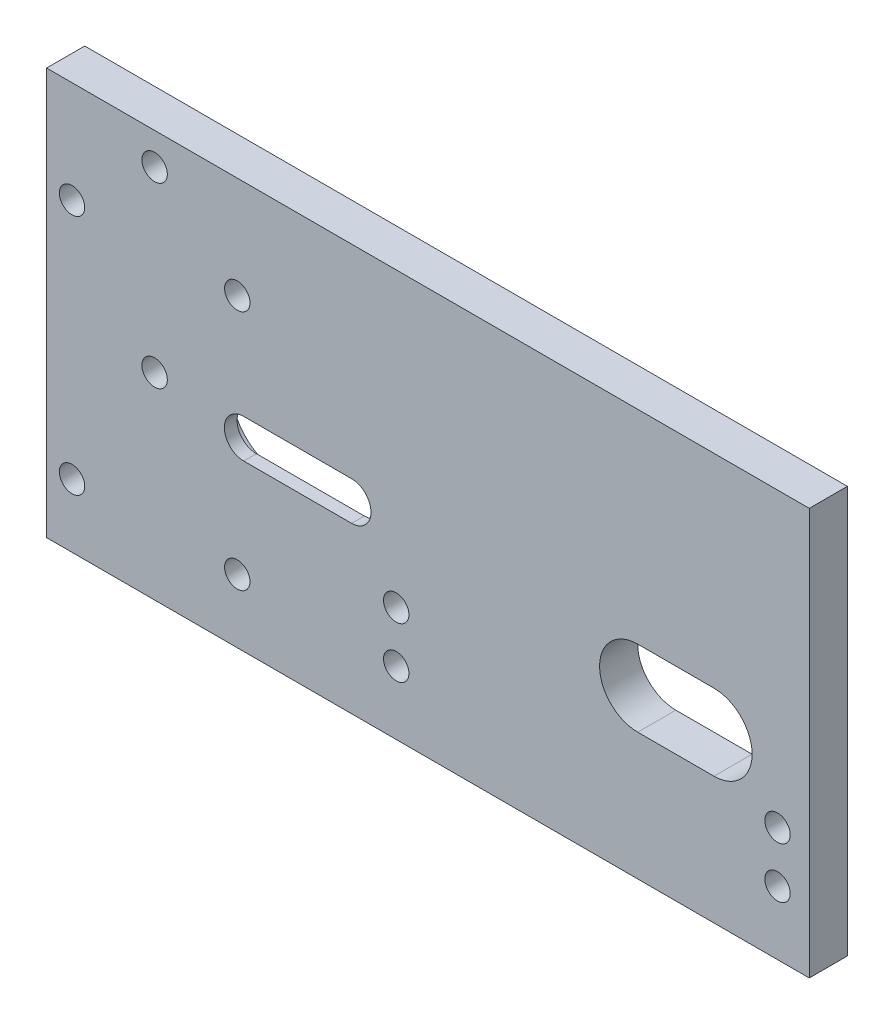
ISO-10303-21;
HEADER;
FILE_DESCRIPTION(('STEP AP214'),'2;1');
FILE_NAME('part.step','',(''),(''),'','','');
FILE_SCHEMA(('AUTOMOTIVE_DESIGN { 1 0 10303 214 1 1 1 1 }'));
ENDSEC;
DATA;
#1=APPLICATION_CONTEXT('core data for automotive mechanical design processes');
#2=APPLICATION_PROTOCOL_DEFINITION('international standard','automotive_design',2000,#1);
#3=PRODUCT_CONTEXT('',#1,'mechanical');
#4=PRODUCT('Part','Part','',(#3));
#5=PRODUCT_RELATED_PRODUCT_CATEGORY('part','',(#4));
#6=PRODUCT_DEFINITION_FORMATION('','',#4);
#7=PRODUCT_DEFINITION_CONTEXT('part definition',#1,'design');
#8=PRODUCT_DEFINITION('design','',#6,#7);
#9=PRODUCT_DEFINITION_SHAPE('','',#8);
#10=(LENGTH_UNIT() NAMED_UNIT(*) SI_UNIT(.MILLI.,.METRE.));
#11=(NAMED_UNIT(*) PLANE_ANGLE_UNIT() SI_UNIT($,.RADIAN.));
#12=(NAMED_UNIT(*) SI_UNIT($,.STERADIAN.) SOLID_ANGLE_UNIT());
#13=UNCERTAINTY_MEASURE_WITH_UNIT(LENGTH_MEASURE(1.E-05),#10,'distance_accuracy_value','');
#14=(GEOMETRIC_REPRESENTATION_CONTEXT(3) GLOBAL_UNCERTAINTY_ASSIGNED_CONTEXT((#13)) GLOBAL_UNIT_ASSIGNED_CONTEXT((#10,
#11,#12)) REPRESENTATION_CONTEXT('',''));
#15=CARTESIAN_POINT('',(0.,0.,0.));
#16=DIRECTION('',(0.,0.,1.));
#17=DIRECTION('',(1.,0.,0.));
#18=AXIS2_PLACEMENT_3D('',#15,#16,#17);
#19=CARTESIAN_POINT('',(0.,0.,0.));
#20=DIRECTION('',(0.,0.,1.));
#21=DIRECTION('',(1.,0.,0.));
#22=AXIS2_PLACEMENT_3D('',#19,#20,#21);
#23=PLANE('',#22);
#24=CARTESIAN_POINT('',(26.9748,93.6752,0.));
#25=DIRECTION('',(0.,0.,1.));
#26=DIRECTION('',(1.,0.,0.));
#27=AXIS2_PLACEMENT_3D('',#24,#25,#26);
#28=CIRCLE('',#27,3.175);
#29=CARTESIAN_POINT('',(23.7998,93.6752,0.));
#30=VERTEX_POINT('',#29);
#31=EDGE_CURVE('E176',#30,#30,#28,.T.);
#32=ORIENTED_EDGE('',*,*,#31,.T.);
#33=EDGE_LOOP('',(#32));
#34=FACE_BOUND('',#33,.T.);
#35=CARTESIAN_POINT('',(147.6502,41.275,0.));
#36=DIRECTION('',(0.,0.,1.));
#37=DIRECTION('',(1.,0.,0.));
#38=AXIS2_PLACEMENT_3D('',#35,#36,#37);
#39=CIRCLE('',#38,9.525);
#40=CARTESIAN_POINT('',(147.6502,50.8,0.));
#41=VERTEX_POINT('',#40);
#42=CARTESIAN_POINT('',(147.6502,31.75,0.));
#43=VERTEX_POINT('',#42);
#44=EDGE_CURVE('E186',#41,#43,#39,.T.);
#45=ORIENTED_EDGE('',*,*,#44,.T.);
#46=DIRECTION('',(1.,0.,0.));
#47=VECTOR('',#46,1.);
#48=CARTESIAN_POINT('',(147.6502,31.75,0.));
#49=LINE('',#48,#47);
#50=CARTESIAN_POINT('',(166.7002,31.75,0.));
#51=VERTEX_POINT('',#50);
#52=EDGE_CURVE('E202',#43,#51,#49,.T.);
#53=ORIENTED_EDGE('',*,*,#52,.T.);
#54=CARTESIAN_POINT('',(166.7002,41.275,0.));
#55=DIRECTION('',(0.,0.,1.));
#56=DIRECTION('',(1.,0.,0.));
#57=AXIS2_PLACEMENT_3D('',#54,#55,#56);
#58=CIRCLE('',#57,9.525);
#59=CARTESIAN_POINT('',(166.7002,50.8,0.));
#60=VERTEX_POINT('',#59);
#61=EDGE_CURVE('E205',#51,#60,#58,.T.);
#62=ORIENTED_EDGE('',*,*,#61,.T.);
#63=DIRECTION('',(-1.,0.,0.));
#64=VECTOR('',#63,1.);
#65=CARTESIAN_POINT('',(147.6502,50.8,0.));
#66=LINE('',#65,#64);
#67=EDGE_CURVE('E192',#60,#41,#66,.T.);
#68=ORIENTED_EDGE('',*,*,#67,.T.);
#69=EDGE_LOOP('',(#45,#53,#62,#68));
#70=FACE_BOUND('',#69,.T.);
#71=CARTESIAN_POINT('',(182.5752,28.575,0.));
#72=DIRECTION('',(0.,0.,1.));
#73=DIRECTION('',(1.,0.,0.));
#74=AXIS2_PLACEMENT_3D('',#71,#72,#73);
#75=CIRCLE('',#74,3.175);
#76=CARTESIAN_POINT('',(179.4002,28.575,0.));
#77=VERTEX_POINT('',#76);
#78=EDGE_CURVE('E240',#77,#77,#75,.T.);
#79=ORIENTED_EDGE('',*,*,#78,.T.);
#80=EDGE_LOOP('',(#79));
#81=FACE_BOUND('',#80,.T.);
#82=CARTESIAN_POINT('',(87.3252,28.575,0.));
#83=DIRECTION('',(0.,0.,1.));
#84=DIRECTION('',(1.,0.,0.));
#85=AXIS2_PLACEMENT_3D('',#82,#83,#84);
#86=CIRCLE('',#85,3.175);
#87=CARTESIAN_POINT('',(84.1502,28.575,0.));
#88=VERTEX_POINT('',#87);
#89=EDGE_CURVE('E250',#88,#88,#86,.T.);
#90=ORIENTED_EDGE('',*,*,#89,.T.);
#91=EDGE_LOOP('',(#90));
#92=FACE_BOUND('',#91,.T.);
#93=CARTESIAN_POINT('',(47.625,76.1873,0.));
#94=DIRECTION('',(0.,0.,1.));
#95=DIRECTION('',(1.,0.,0.));
#96=AXIS2_PLACEMENT_3D('',#93,#94,#95);
#97=CIRCLE('',#96,3.17500000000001);
#98=CARTESIAN_POINT('',(44.45,76.1873,0.));
#99=VERTEX_POINT('',#98);
#100=EDGE_CURVE('E262',#99,#99,#97,.T.);
#101=ORIENTED_EDGE('',*,*,#100,.T.);
#102=EDGE_LOOP('',(#101));
#103=FACE_BOUND('',#102,.T.);
#104=CARTESIAN_POINT('',(6.35000000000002,15.8623,0.));
#105=DIRECTION('',(0.,0.,1.));
#106=DIRECTION('',(1.,0.,0.));
#107=AXIS2_PLACEMENT_3D('',#104,#105,#106);
#108=CIRCLE('',#107,3.175);
#109=CARTESIAN_POINT('',(3.17500000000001,15.8623,0.));
#110=VERTEX_POINT('',#109);
#111=EDGE_CURVE('E274',#110,#110,#108,.T.);
#112=ORIENTED_EDGE('',*,*,#111,.T.);
#113=EDGE_LOOP('',(#112));
#114=FACE_BOUND('',#113,.T.);
#115=DIRECTION('',(0.,-1.,0.));
#116=VECTOR('',#115,1.);
#117=CARTESIAN_POINT('',(0.,101.6,0.));
#118=LINE('',#117,#116);
#119=CARTESIAN_POINT('',(0.,101.6,0.));
#120=VERTEX_POINT('',#119);
#121=CARTESIAN_POINT('',(0.,0.,0.));
#122=VERTEX_POINT('',#121);
#123=EDGE_CURVE('E286',#120,#122,#118,.T.);
#124=ORIENTED_EDGE('',*,*,#123,.F.);
#125=DIRECTION('',(-1.,0.,0.));
#126=VECTOR('',#125,1.);
#127=CARTESIAN_POINT('',(190.5,101.6,0.));
#128=LINE('',#127,#126);
#129=CARTESIAN_POINT('',(190.5,101.6,0.));
#130=VERTEX_POINT('',#129);
#131=EDGE_CURVE('E293',#130,#120,#128,.T.);
#132=ORIENTED_EDGE('',*,*,#131,.F.);
#133=DIRECTION('',(0.,1.,0.));
#134=VECTOR('',#133,1.);
#135=CARTESIAN_POINT('',(190.5,0.,0.));
#136=LINE('',#135,#134);
#137=CARTESIAN_POINT('',(190.5,0.,0.));
#138=VERTEX_POINT('',#137);
#139=EDGE_CURVE('E304',#138,#130,#136,.T.);
#140=ORIENTED_EDGE('',*,*,#139,.F.);
#141=DIRECTION('',(1.,0.,0.));
#142=VECTOR('',#141,1.);
#143=CARTESIAN_POINT('',(0.,0.,0.));
#144=LINE('',#143,#142);
#145=EDGE_CURVE('E302',#122,#138,#144,.T.);
#146=ORIENTED_EDGE('',*,*,#145,.F.);
#147=EDGE_LOOP('',(#124,#132,#140,#146));
#148=FACE_BOUND('',#147,.T.);
#149=CARTESIAN_POINT('',(47.625,15.8623,0.));
#150=DIRECTION('',(0.,0.,1.));
#151=DIRECTION('',(1.,0.,0.));
#152=AXIS2_PLACEMENT_3D('',#149,#150,#151);
#153=CIRCLE('',#152,3.175);
#154=CARTESIAN_POINT('',(44.45,15.8623,0.));
#155=VERTEX_POINT('',#154);
#156=EDGE_CURVE('E280',#155,#155,#153,.T.);
#157=ORIENTED_EDGE('',*,*,#156,.T.);
#158=EDGE_LOOP('',(#157));
#159=FACE_BOUND('',#158,.T.);
#160=CARTESIAN_POINT('',(6.35000000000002,76.1873,0.));
#161=DIRECTION('',(0.,0.,1.));
#162=DIRECTION('',(1.,0.,0.));
#163=AXIS2_PLACEMENT_3D('',#160,#161,#162);
#164=CIRCLE('',#163,3.17499999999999);
#165=CARTESIAN_POINT('',(3.17500000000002,76.1873,0.));
#166=VERTEX_POINT('',#165);
#167=EDGE_CURVE('E268',#166,#166,#164,.T.);
#168=ORIENTED_EDGE('',*,*,#167,.T.);
#169=EDGE_LOOP('',(#168));
#170=FACE_BOUND('',#169,.T.);
#171=CARTESIAN_POINT('',(87.3252,15.875,0.));
#172=DIRECTION('',(0.,0.,1.));
#173=DIRECTION('',(1.,0.,0.));
#174=AXIS2_PLACEMENT_3D('',#171,#172,#173);
#175=CIRCLE('',#174,3.175);
#176=CARTESIAN_POINT('',(84.1502,15.875,0.));
#177=VERTEX_POINT('',#176);
#178=EDGE_CURVE('E256',#177,#177,#175,.T.);
#179=ORIENTED_EDGE('',*,*,#178,.T.);
#180=EDGE_LOOP('',(#179));
#181=FACE_BOUND('',#180,.T.);
#182=CARTESIAN_POINT('',(182.5752,15.875,0.));
#183=DIRECTION('',(0.,0.,1.));
#184=DIRECTION('',(1.,0.,0.));
#185=AXIS2_PLACEMENT_3D('',#182,#183,#184);
#186=CIRCLE('',#185,3.17499999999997);
#187=CARTESIAN_POINT('',(179.4002,15.875,0.));
#188=VERTEX_POINT('',#187);
#189=EDGE_CURVE('E244',#188,#188,#186,.T.);
#190=ORIENTED_EDGE('',*,*,#189,.T.);
#191=EDGE_LOOP('',(#190));
#192=FACE_BOUND('',#191,.T.);
#193=CARTESIAN_POINT('',(26.9748,49.2252,0.));
#194=DIRECTION('',(0.,0.,1.));
#195=DIRECTION('',(1.,0.,0.));
#196=AXIS2_PLACEMENT_3D('',#193,#194,#195);
#197=CIRCLE('',#196,3.175);
#198=CARTESIAN_POINT('',(23.7998,49.2252,0.));
#199=VERTEX_POINT('',#198);
#200=EDGE_CURVE('E180',#199,#199,#197,.T.);
#201=ORIENTED_EDGE('',*,*,#200,.T.);
#202=EDGE_LOOP('',(#201));
#203=FACE_BOUND('',#202,.T.);
#204=CARTESIAN_POINT('',(49.2252,46.0248,0.));
#205=DIRECTION('',(0.,0.,1.));
#206=DIRECTION('',(1.,0.,0.));
#207=AXIS2_PLACEMENT_3D('',#204,#205,#206);
#208=CIRCLE('',#207,12.7);
#209=CARTESIAN_POINT('',(49.2252,58.7248,0.));
#210=VERTEX_POINT('',#209);
#211=CARTESIAN_POINT('',(49.2252,33.3248,0.));
#212=VERTEX_POINT('',#211);
#213=EDGE_CURVE('E48',#210,#212,#208,.T.);
#214=ORIENTED_EDGE('',*,*,#213,.T.);
#215=DIRECTION('',(1.,0.,0.));
#216=VECTOR('',#215,1.);
#217=CARTESIAN_POINT('',(49.2252,33.3248,0.));
#218=LINE('',#217,#216);
#219=CARTESIAN_POINT('',(76.2,33.3248,0.));
#220=VERTEX_POINT('',#219);
#221=EDGE_CURVE('E164',#212,#220,#218,.T.);
#222=ORIENTED_EDGE('',*,*,#221,.T.);
#223=CARTESIAN_POINT('',(76.2,46.0248,0.));
#224=DIRECTION('',(0.,0.,1.));
#225=DIRECTION('',(1.,0.,0.));
#226=AXIS2_PLACEMENT_3D('',#223,#224,#225);
#227=CIRCLE('',#226,12.7);
#228=CARTESIAN_POINT('',(76.2,58.7248,0.));
#229=VERTEX_POINT('',#228);
#230=EDGE_CURVE('E648',#220,#229,#227,.T.);
#231=ORIENTED_EDGE('',*,*,#230,.T.);
#232=DIRECTION('',(-1.,0.,0.));
#233=VECTOR('',#232,1.);
#234=CARTESIAN_POINT('',(49.2252,58.7248,0.));
#235=LINE('',#234,#233);
#236=EDGE_CURVE('E160',#229,#210,#235,.T.);
#237=ORIENTED_EDGE('',*,*,#236,.T.);
#238=EDGE_LOOP('',(#214,#222,#231,#237));
#239=FACE_BOUND('',#238,.T.);
#240=ADVANCED_FACE('F33',(#34,#70,#81,#92,#103,#114,#148,#159,#170,#181,#192,#203,#239),#23,.F.);
#241=CARTESIAN_POINT('',(0.,0.,9.525));
#242=DIRECTION('',(0.,0.,1.));
#243=DIRECTION('',(1.,0.,0.));
#244=AXIS2_PLACEMENT_3D('',#241,#242,#243);
#245=PLANE('',#244);
#246=CARTESIAN_POINT('',(26.9748,49.2252,9.525));
#247=DIRECTION('',(0.,0.,1.));
#248=DIRECTION('',(1.,0.,0.));
#249=AXIS2_PLACEMENT_3D('',#246,#247,#248);
#250=CIRCLE('',#249,3.175);
#251=CARTESIAN_POINT('',(23.7998,49.2252,9.525));
#252=VERTEX_POINT('',#251);
#253=EDGE_CURVE('E183',#252,#252,#250,.T.);
#254=ORIENTED_EDGE('',*,*,#253,.F.);
#255=EDGE_LOOP('',(#254));
#256=FACE_BOUND('',#255,.T.);
#257=DIRECTION('',(1.,0.,0.));
#258=VECTOR('',#257,1.);
#259=CARTESIAN_POINT('',(49.2252,41.1988,9.525));
#260=LINE('',#259,#258);
#261=CARTESIAN_POINT('',(49.2252,41.1988,9.525));
#262=VERTEX_POINT('',#261);
#263=CARTESIAN_POINT('',(76.2,41.1988,9.525));
#264=VERTEX_POINT('',#263);
#265=EDGE_CURVE('E221',#262,#264,#260,.T.);
#266=ORIENTED_EDGE('',*,*,#265,.F.);
#267=CARTESIAN_POINT('',(49.2252,46.0248,9.525));
#268=DIRECTION('',(0.,0.,1.));
#269=DIRECTION('',(1.,0.,0.));
#270=AXIS2_PLACEMENT_3D('',#267,#268,#269);
#271=CIRCLE('',#270,4.826);
#272=CARTESIAN_POINT('',(49.2252,50.8508,9.525));
#273=VERTEX_POINT('',#272);
#274=EDGE_CURVE('E219',#273,#262,#271,.T.);
#275=ORIENTED_EDGE('',*,*,#274,.F.);
#276=DIRECTION('',(-1.,0.,0.));
#277=VECTOR('',#276,1.);
#278=CARTESIAN_POINT('',(49.2252,50.8508,9.525));
#279=LINE('',#278,#277);
#280=CARTESIAN_POINT('',(76.2,50.8508,9.525));
#281=VERTEX_POINT('',#280);
#282=EDGE_CURVE('E226',#281,#273,#279,.T.);
#283=ORIENTED_EDGE('',*,*,#282,.F.);
#284=CARTESIAN_POINT('',(76.2,46.0248,9.525));
#285=DIRECTION('',(0.,0.,1.));
#286=DIRECTION('',(1.,0.,0.));
#287=AXIS2_PLACEMENT_3D('',#284,#285,#286);
#288=CIRCLE('',#287,4.826);
#289=EDGE_CURVE('E223',#264,#281,#288,.T.);
#290=ORIENTED_EDGE('',*,*,#289,.F.);
#291=EDGE_LOOP('',(#266,#275,#283,#290));
#292=FACE_BOUND('',#291,.T.);
#293=CARTESIAN_POINT('',(182.5752,15.875,9.525));
#294=DIRECTION('',(0.,0.,1.));
#295=DIRECTION('',(1.,0.,0.));
#296=AXIS2_PLACEMENT_3D('',#293,#294,#295);
#297=CIRCLE('',#296,3.17499999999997);
#298=CARTESIAN_POINT('',(179.4002,15.875,9.525));
#299=VERTEX_POINT('',#298);
#300=EDGE_CURVE('E247',#299,#299,#297,.T.);
#301=ORIENTED_EDGE('',*,*,#300,.F.);
#302=EDGE_LOOP('',(#301));
#303=FACE_BOUND('',#302,.T.);
#304=CARTESIAN_POINT('',(87.3252,15.875,9.525));
#305=DIRECTION('',(0.,0.,1.));
#306=DIRECTION('',(1.,0.,0.));
#307=AXIS2_PLACEMENT_3D('',#304,#305,#306);
#308=CIRCLE('',#307,3.175);
#309=CARTESIAN_POINT('',(84.1502,15.875,9.525));
#310=VERTEX_POINT('',#309);
#311=EDGE_CURVE('E259',#310,#310,#308,.T.);
#312=ORIENTED_EDGE('',*,*,#311,.F.);
#313=EDGE_LOOP('',(#312));
#314=FACE_BOUND('',#313,.T.);
#315=CARTESIAN_POINT('',(6.35000000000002,76.1873,9.525));
#316=DIRECTION('',(0.,0.,1.));
#317=DIRECTION('',(1.,0.,0.));
#318=AXIS2_PLACEMENT_3D('',#315,#316,#317);
#319=CIRCLE('',#318,3.17499999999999);
#320=CARTESIAN_POINT('',(3.17500000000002,76.1873,9.525));
#321=VERTEX_POINT('',#320);
#322=EDGE_CURVE('E271',#321,#321,#319,.T.);
#323=ORIENTED_EDGE('',*,*,#322,.F.);
#324=EDGE_LOOP('',(#323));
#325=FACE_BOUND('',#324,.T.);
#326=CARTESIAN_POINT('',(47.625,15.8623,9.525));
#327=DIRECTION('',(0.,0.,1.));
#328=DIRECTION('',(1.,0.,0.));
#329=AXIS2_PLACEMENT_3D('',#326,#327,#328);
#330=CIRCLE('',#329,3.175);
#331=CARTESIAN_POINT('',(44.45,15.8623,9.525));
#332=VERTEX_POINT('',#331);
#333=EDGE_CURVE('E283',#332,#332,#330,.T.);
#334=ORIENTED_EDGE('',*,*,#333,.F.);
#335=EDGE_LOOP('',(#334));
#336=FACE_BOUND('',#335,.T.);
#337=DIRECTION('',(0.,-1.,0.));
#338=VECTOR('',#337,1.);
#339=CARTESIAN_POINT('',(0.,101.6,9.525));
#340=LINE('',#339,#338);
#341=CARTESIAN_POINT('',(0.,101.6,9.525));
#342=VERTEX_POINT('',#341);
#343=CARTESIAN_POINT('',(0.,0.,9.525));
#344=VERTEX_POINT('',#343);
#345=EDGE_CURVE('E289',#342,#344,#340,.T.);
#346=ORIENTED_EDGE('',*,*,#345,.T.);
#347=DIRECTION('',(1.,0.,0.));
#348=VECTOR('',#347,1.);
#349=CARTESIAN_POINT('',(0.,0.,9.525));
#350=LINE('',#349,#348);
#351=CARTESIAN_POINT('',(190.5,0.,9.525));
#352=VERTEX_POINT('',#351);
#353=EDGE_CURVE('E292',#344,#352,#350,.T.);
#354=ORIENTED_EDGE('',*,*,#353,.T.);
#355=DIRECTION('',(0.,1.,0.));
#356=VECTOR('',#355,1.);
#357=CARTESIAN_POINT('',(190.5,0.,9.525));
#358=LINE('',#357,#356);
#359=CARTESIAN_POINT('',(190.5,101.6,9.525));
#360=VERTEX_POINT('',#359);
#361=EDGE_CURVE('E295',#352,#360,#358,.T.);
#362=ORIENTED_EDGE('',*,*,#361,.T.);
#363=DIRECTION('',(-1.,0.,0.));
#364=VECTOR('',#363,1.);
#365=CARTESIAN_POINT('',(190.5,101.6,9.525));
#366=LINE('',#365,#364);
#367=EDGE_CURVE('E297',#360,#342,#366,.T.);
#368=ORIENTED_EDGE('',*,*,#367,.T.);
#369=EDGE_LOOP('',(#346,#354,#362,#368));
#370=FACE_BOUND('',#369,.T.);
#371=CARTESIAN_POINT('',(6.35000000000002,15.8623,9.525));
#372=DIRECTION('',(0.,0.,1.));
#373=DIRECTION('',(1.,0.,0.));
#374=AXIS2_PLACEMENT_3D('',#371,#372,#373);
#375=CIRCLE('',#374,3.175);
#376=CARTESIAN_POINT('',(3.17500000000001,15.8623,9.525));
#377=VERTEX_POINT('',#376);
#378=EDGE_CURVE('E277',#377,#377,#375,.T.);
#379=ORIENTED_EDGE('',*,*,#378,.F.);
#380=EDGE_LOOP('',(#379));
#381=FACE_BOUND('',#380,.T.);
#382=CARTESIAN_POINT('',(47.625,76.1873,9.525));
#383=DIRECTION('',(0.,0.,1.));
#384=DIRECTION('',(1.,0.,0.));
#385=AXIS2_PLACEMENT_3D('',#382,#383,#384);
#386=CIRCLE('',#385,3.17500000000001);
#387=CARTESIAN_POINT('',(44.45,76.1873,9.525));
#388=VERTEX_POINT('',#387);
#389=EDGE_CURVE('E265',#388,#388,#386,.T.);
#390=ORIENTED_EDGE('',*,*,#389,.F.);
#391=EDGE_LOOP('',(#390));
#392=FACE_BOUND('',#391,.T.);
#393=CARTESIAN_POINT('',(87.3252,28.575,9.525));
#394=DIRECTION('',(0.,0.,1.));
#395=DIRECTION('',(1.,0.,0.));
#396=AXIS2_PLACEMENT_3D('',#393,#394,#395);
#397=CIRCLE('',#396,3.175);
#398=CARTESIAN_POINT('',(84.1502,28.575,9.525));
#399=VERTEX_POINT('',#398);
#400=EDGE_CURVE('E253',#399,#399,#397,.T.);
#401=ORIENTED_EDGE('',*,*,#400,.F.);
#402=EDGE_LOOP('',(#401));
#403=FACE_BOUND('',#402,.T.);
#404=CARTESIAN_POINT('',(182.5752,28.575,9.525));
#405=DIRECTION('',(0.,0.,1.));
#406=DIRECTION('',(1.,0.,0.));
#407=AXIS2_PLACEMENT_3D('',#404,#405,#406);
#408=CIRCLE('',#407,3.175);
#409=CARTESIAN_POINT('',(179.4002,28.575,9.525));
#410=VERTEX_POINT('',#409);
#411=EDGE_CURVE('E241',#410,#410,#408,.T.);
#412=ORIENTED_EDGE('',*,*,#411,.F.);
#413=EDGE_LOOP('',(#412));
#414=FACE_BOUND('',#413,.T.);
#415=DIRECTION('',(1.,0.,0.));
#416=VECTOR('',#415,1.);
#417=CARTESIAN_POINT('',(147.6502,31.75,9.525));
#418=LINE('',#417,#416);
#419=CARTESIAN_POINT('',(147.6502,31.75,9.525));
#420=VERTEX_POINT('',#419);
#421=CARTESIAN_POINT('',(166.7002,31.75,9.525));
#422=VERTEX_POINT('',#421);
#423=EDGE_CURVE('E191',#420,#422,#418,.T.);
#424=ORIENTED_EDGE('',*,*,#423,.F.);
#425=CARTESIAN_POINT('',(147.6502,41.275,9.525));
#426=DIRECTION('',(0.,0.,1.));
#427=DIRECTION('',(1.,0.,0.));
#428=AXIS2_PLACEMENT_3D('',#425,#426,#427);
#429=CIRCLE('',#428,9.525);
#430=CARTESIAN_POINT('',(147.6502,50.8,9.525));
#431=VERTEX_POINT('',#430);
#432=EDGE_CURVE('E189',#431,#420,#429,.T.);
#433=ORIENTED_EDGE('',*,*,#432,.F.);
#434=DIRECTION('',(-1.,0.,0.));
#435=VECTOR('',#434,1.);
#436=CARTESIAN_POINT('',(147.6502,50.8,9.525));
#437=LINE('',#436,#435);
#438=CARTESIAN_POINT('',(166.7002,50.8,9.525));
#439=VERTEX_POINT('',#438);
#440=EDGE_CURVE('E197',#439,#431,#437,.T.);
#441=ORIENTED_EDGE('',*,*,#440,.F.);
#442=CARTESIAN_POINT('',(166.7002,41.275,9.525));
#443=DIRECTION('',(0.,0.,1.));
#444=DIRECTION('',(1.,0.,0.));
#445=AXIS2_PLACEMENT_3D('',#442,#443,#444);
#446=CIRCLE('',#445,9.525);
#447=EDGE_CURVE('E194',#422,#439,#446,.T.);
#448=ORIENTED_EDGE('',*,*,#447,.F.);
#449=EDGE_LOOP('',(#424,#433,#441,#448));
#450=FACE_BOUND('',#449,.T.);
#451=CARTESIAN_POINT('',(26.9748,93.6752,9.525));
#452=DIRECTION('',(0.,0.,1.));
#453=DIRECTION('',(1.,0.,0.));
#454=AXIS2_PLACEMENT_3D('',#451,#452,#453);
#455=CIRCLE('',#454,3.175);
#456=CARTESIAN_POINT('',(23.7998,93.6752,9.525));
#457=VERTEX_POINT('',#456);
#458=EDGE_CURVE('E177',#457,#457,#455,.T.);
#459=ORIENTED_EDGE('',*,*,#458,.F.);
#460=EDGE_LOOP('',(#459));
#461=FACE_BOUND('',#460,.T.);
#462=ADVANCED_FACE('F335',(#256,#292,#303,#314,#325,#336,#370,#381,#392,#403,#414,#450,#461),
#245,.T.);
#463=CARTESIAN_POINT('',(0.,101.6,9.525));
#464=DIRECTION('',(1.,0.,0.));
#465=DIRECTION('',(0.,0.,-1.));
#466=AXIS2_PLACEMENT_3D('',#463,#464,#465);
#467=PLANE('',#466);
#468=ORIENTED_EDGE('',*,*,#123,.T.);
#469=DIRECTION('',(0.,0.,-1.));
#470=VECTOR('',#469,1.);
#471=CARTESIAN_POINT('',(0.,0.,9.525));
#472=LINE('',#471,#470);
#473=EDGE_CURVE('E41',#344,#122,#472,.T.);
#474=ORIENTED_EDGE('',*,*,#473,.F.);
#475=ORIENTED_EDGE('',*,*,#345,.F.);
#476=DIRECTION('',(0.,0.,-1.));
#477=VECTOR('',#476,1.);
#478=CARTESIAN_POINT('',(0.,101.6,9.525));
#479=LINE('',#478,#477);
#480=EDGE_CURVE('E299',#342,#120,#479,.T.);
#481=ORIENTED_EDGE('',*,*,#480,.T.);
#482=EDGE_LOOP('',(#468,#474,#475,#481));
#483=FACE_BOUND('',#482,.T.);
#484=ADVANCED_FACE('F35',(#483),#467,.F.);
#485=CARTESIAN_POINT('',(0.,0.,9.525));
#486=DIRECTION('',(0.,1.,0.));
#487=DIRECTION('',(0.,0.,1.));
#488=AXIS2_PLACEMENT_3D('',#485,#486,#487);
#489=PLANE('',#488);
#490=ORIENTED_EDGE('',*,*,#145,.T.);
#491=DIRECTION('',(0.,0.,-1.));
#492=VECTOR('',#491,1.);
#493=CARTESIAN_POINT('',(190.5,0.,9.525));
#494=LINE('',#493,#492);
#495=EDGE_CURVE('E312',#352,#138,#494,.T.);
#496=ORIENTED_EDGE('',*,*,#495,.F.);
#497=ORIENTED_EDGE('',*,*,#353,.F.);
#498=ORIENTED_EDGE('',*,*,#473,.T.);
#499=EDGE_LOOP('',(#490,#496,#497,#498));
#500=FACE_BOUND('',#499,.T.);
#501=ADVANCED_FACE('F317',(#500),#489,.F.);
#502=CARTESIAN_POINT('',(190.5,0.,9.525));
#503=DIRECTION('',(-1.,0.,0.));
#504=DIRECTION('',(0.,0.,1.));
#505=AXIS2_PLACEMENT_3D('',#502,#503,#504);
#506=PLANE('',#505);
#507=ORIENTED_EDGE('',*,*,#139,.T.);
#508=DIRECTION('',(0.,0.,-1.));
#509=VECTOR('',#508,1.);
#510=CARTESIAN_POINT('',(190.5,101.6,9.525));
#511=LINE('',#510,#509);
#512=EDGE_CURVE('E309',#360,#130,#511,.T.);
#513=ORIENTED_EDGE('',*,*,#512,.F.);
#514=ORIENTED_EDGE('',*,*,#361,.F.);
#515=ORIENTED_EDGE('',*,*,#495,.T.);
#516=EDGE_LOOP('',(#507,#513,#514,#515));
#517=FACE_BOUND('',#516,.T.);
#518=ADVANCED_FACE('F329',(#517),#506,.F.);
#519=CARTESIAN_POINT('',(190.5,101.6,9.525));
#520=DIRECTION('',(0.,-1.,0.));
#521=DIRECTION('',(1.,0.,0.));
#522=AXIS2_PLACEMENT_3D('',#519,#520,#521);
#523=PLANE('',#522);
#524=ORIENTED_EDGE('',*,*,#131,.T.);
#525=ORIENTED_EDGE('',*,*,#480,.F.);
#526=ORIENTED_EDGE('',*,*,#367,.F.);
#527=ORIENTED_EDGE('',*,*,#512,.T.);
#528=EDGE_LOOP('',(#524,#525,#526,#527));
#529=FACE_BOUND('',#528,.T.);
#530=ADVANCED_FACE('F333',(#529),#523,.F.);
#531=CARTESIAN_POINT('',(47.625,15.8623,9.525));
#532=DIRECTION('',(0.,0.,-1.));
#533=DIRECTION('',(-1.,0.,0.));
#534=AXIS2_PLACEMENT_3D('',#531,#532,#533);
#535=CYLINDRICAL_SURFACE('',#534,3.175);
#536=CARTESIAN_POINT('',(44.45,15.8623,9.525));
#537=CARTESIAN_POINT('',(44.45,15.8623,9.42578125));
#538=CARTESIAN_POINT('',(44.45,15.8623,9.3265625));
#539=CARTESIAN_POINT('',(44.45,15.8623,9.128125));
#540=CARTESIAN_POINT('',(44.45,15.8623,9.02890625));
#541=CARTESIAN_POINT('',(44.45,15.8623,8.83046875));
#542=CARTESIAN_POINT('',(44.45,15.8623,8.73125));
#543=CARTESIAN_POINT('',(44.45,15.8623,8.5328125));
#544=CARTESIAN_POINT('',(44.45,15.8623,8.43359375));
#545=CARTESIAN_POINT('',(44.45,15.8623,8.23515625));
#546=CARTESIAN_POINT('',(44.45,15.8623,8.1359375));
#547=CARTESIAN_POINT('',(44.45,15.8623,7.9375));
#548=CARTESIAN_POINT('',(44.45,15.8623,7.83828125));
#549=CARTESIAN_POINT('',(44.45,15.8623,7.63984375));
#550=CARTESIAN_POINT('',(44.45,15.8623,7.540625));
#551=CARTESIAN_POINT('',(44.45,15.8623,7.3421875));
#552=CARTESIAN_POINT('',(44.45,15.8623,7.24296875));
#553=CARTESIAN_POINT('',(44.45,15.8623,7.04453125));
#554=CARTESIAN_POINT('',(44.45,15.8623,6.9453125));
#555=CARTESIAN_POINT('',(44.45,15.8623,6.746875));
#556=CARTESIAN_POINT('',(44.45,15.8623,6.64765625));
#557=CARTESIAN_POINT('',(44.45,15.8623,6.44921875));
#558=CARTESIAN_POINT('',(44.45,15.8623,6.35));
#559=CARTESIAN_POINT('',(44.45,15.8623,6.1515625));
#560=CARTESIAN_POINT('',(44.45,15.8623,6.05234375));
#561=CARTESIAN_POINT('',(44.45,15.8623,5.85390625));
#562=CARTESIAN_POINT('',(44.45,15.8623,5.7546875));
#563=CARTESIAN_POINT('',(44.45,15.8623,5.55625));
#564=CARTESIAN_POINT('',(44.45,15.8623,5.45703125));
#565=CARTESIAN_POINT('',(44.45,15.8623,5.25859375));
#566=CARTESIAN_POINT('',(44.45,15.8623,5.159375));
#567=CARTESIAN_POINT('',(44.45,15.8623,4.9609375));
#568=CARTESIAN_POINT('',(44.45,15.8623,4.86171875));
#569=CARTESIAN_POINT('',(44.45,15.8623,4.66328125));
#570=CARTESIAN_POINT('',(44.45,15.8623,4.5640625));
#571=CARTESIAN_POINT('',(44.45,15.8623,4.365625));
#572=CARTESIAN_POINT('',(44.45,15.8623,4.26640625));
#573=CARTESIAN_POINT('',(44.45,15.8623,4.06796875));
#574=CARTESIAN_POINT('',(44.45,15.8623,3.96875));
#575=CARTESIAN_POINT('',(44.45,15.8623,3.7703125));
#576=CARTESIAN_POINT('',(44.45,15.8623,3.67109375));
#577=CARTESIAN_POINT('',(44.45,15.8623,3.47265625));
#578=CARTESIAN_POINT('',(44.45,15.8623,3.3734375));
#579=CARTESIAN_POINT('',(44.45,15.8623,3.175));
#580=CARTESIAN_POINT('',(44.45,15.8623,3.07578125));
#581=CARTESIAN_POINT('',(44.45,15.8623,2.87734375));
#582=CARTESIAN_POINT('',(44.45,15.8623,2.778125));
#583=CARTESIAN_POINT('',(44.45,15.8623,2.5796875));
#584=CARTESIAN_POINT('',(44.45,15.8623,2.48046875));
#585=CARTESIAN_POINT('',(44.45,15.8623,2.28203125));
#586=CARTESIAN_POINT('',(44.45,15.8623,2.1828125));
#587=CARTESIAN_POINT('',(44.45,15.8623,1.984375));
#588=CARTESIAN_POINT('',(44.45,15.8623,1.88515625));
#589=CARTESIAN_POINT('',(44.45,15.8623,1.68671875));
#590=CARTESIAN_POINT('',(44.45,15.8623,1.5875));
#591=CARTESIAN_POINT('',(44.45,15.8623,1.3890625));
#592=CARTESIAN_POINT('',(44.45,15.8623,1.28984375));
#593=CARTESIAN_POINT('',(44.45,15.8623,1.09140625));
#594=CARTESIAN_POINT('',(44.45,15.8623,0.992187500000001));
#595=CARTESIAN_POINT('',(44.45,15.8623,0.793750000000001));
#596=CARTESIAN_POINT('',(44.45,15.8623,0.69453125));
#597=CARTESIAN_POINT('',(44.45,15.8623,0.49609375));
#598=CARTESIAN_POINT('',(44.45,15.8623,0.396875));
#599=CARTESIAN_POINT('',(44.45,15.8623,0.1984375));
#600=CARTESIAN_POINT('',(44.45,15.8623,0.0992187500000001));
#601=CARTESIAN_POINT('',(44.45,15.8623,0.));
#602=B_SPLINE_CURVE_WITH_KNOTS('',3,(#536,#537,#538,#539,#540,#541,#542,#543,#544,#545,#546,
#547,#548,#549,#550,#551,#552,#553,#554,#555,#556,#557,#558,#559,#560,#561,#562,#563,#564,#565,
#566,#567,#568,#569,#570,#571,#572,#573,#574,#575,#576,#577,#578,#579,#580,#581,#582,#583,#584,
#585,#586,#587,#588,#589,#590,#591,#592,#593,#594,#595,#596,#597,#598,#599,#600,#601),
.UNSPECIFIED.,.F.,.F.,(4,2,2,2,2,2,2,2,2,2,2,2,2,2,2,2,2,2,2,2,2,2,2,2,2,2,2,2,2,2,2,2,4),(0.,
0.29765625,0.5953125,0.892968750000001,1.190625,1.48828125,1.7859375,2.08359375,2.38125,
2.67890625,2.9765625,3.27421875,3.571875,3.86953125,4.1671875,4.46484375,4.7625,5.06015625,
5.3578125,5.65546875,5.953125,6.25078125,6.5484375,6.84609375,7.14375,7.44140625,7.7390625,
8.03671875,8.334375,8.63203125,8.9296875,9.22734375,9.525),.UNSPECIFIED.);
#603=EDGE_CURVE('BSEAM376',#332,#155,#602,.T.);
#604=ORIENTED_EDGE('',*,*,#333,.T.);
#605=ORIENTED_EDGE('',*,*,#156,.F.);
#606=ORIENTED_EDGE('',*,*,#603,.T.);
#607=ORIENTED_EDGE('',*,*,#603,.F.);
#608=EDGE_LOOP('',(#604,#606,#605,#607));
#609=FACE_BOUND('',#608,.T.);
#610=ADVANCED_FACE('F376',(#609),#535,.F.);
#611=CARTESIAN_POINT('',(6.35000000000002,15.8623,9.525));
#612=DIRECTION('',(0.,0.,-1.));
#613=DIRECTION('',(-1.,0.,0.));
#614=AXIS2_PLACEMENT_3D('',#611,#612,#613);
#615=CYLINDRICAL_SURFACE('',#614,3.175);
#616=CARTESIAN_POINT('',(3.17500000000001,15.8623,9.525));
#617=CARTESIAN_POINT('',(3.17500000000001,15.8623,9.42578125));
#618=CARTESIAN_POINT('',(3.17500000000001,15.8623,9.3265625));
#619=CARTESIAN_POINT('',(3.17500000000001,15.8623,9.128125));
#620=CARTESIAN_POINT('',(3.17500000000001,15.8623,9.02890625));
#621=CARTESIAN_POINT('',(3.17500000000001,15.8623,8.83046875));
#622=CARTESIAN_POINT('',(3.17500000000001,15.8623,8.73125));
#623=CARTESIAN_POINT('',(3.17500000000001,15.8623,8.5328125));
#624=CARTESIAN_POINT('',(3.17500000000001,15.8623,8.43359375));
#625=CARTESIAN_POINT('',(3.17500000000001,15.8623,8.23515625));
#626=CARTESIAN_POINT('',(3.17500000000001,15.8623,8.1359375));
#627=CARTESIAN_POINT('',(3.17500000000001,15.8623,7.9375));
#628=CARTESIAN_POINT('',(3.17500000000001,15.8623,7.83828125));
#629=CARTESIAN_POINT('',(3.17500000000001,15.8623,7.63984375));
#630=CARTESIAN_POINT('',(3.17500000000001,15.8623,7.540625));
#631=CARTESIAN_POINT('',(3.17500000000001,15.8623,7.3421875));
#632=CARTESIAN_POINT('',(3.17500000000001,15.8623,7.24296875));
#633=CARTESIAN_POINT('',(3.17500000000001,15.8623,7.04453125));
#634=CARTESIAN_POINT('',(3.17500000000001,15.8623,6.9453125));
#635=CARTESIAN_POINT('',(3.17500000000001,15.8623,6.746875));
#636=CARTESIAN_POINT('',(3.17500000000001,15.8623,6.64765625));
#637=CARTESIAN_POINT('',(3.17500000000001,15.8623,6.44921875));
#638=CARTESIAN_POINT('',(3.17500000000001,15.8623,6.35));
#639=CARTESIAN_POINT('',(3.17500000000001,15.8623,6.1515625));
#640=CARTESIAN_POINT('',(3.17500000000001,15.8623,6.05234375));
#641=CARTESIAN_POINT('',(3.17500000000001,15.8623,5.85390625));
#642=CARTESIAN_POINT('',(3.17500000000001,15.8623,5.7546875));
#643=CARTESIAN_POINT('',(3.17500000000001,15.8623,5.55625));
#644=CARTESIAN_POINT('',(3.17500000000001,15.8623,5.45703125));
#645=CARTESIAN_POINT('',(3.17500000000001,15.8623,5.25859375));
#646=CARTESIAN_POINT('',(3.17500000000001,15.8623,5.159375));
#647=CARTESIAN_POINT('',(3.17500000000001,15.8623,4.9609375));
#648=CARTESIAN_POINT('',(3.17500000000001,15.8623,4.86171875));
#649=CARTESIAN_POINT('',(3.17500000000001,15.8623,4.66328125));
#650=CARTESIAN_POINT('',(3.17500000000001,15.8623,4.5640625));
#651=CARTESIAN_POINT('',(3.17500000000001,15.8623,4.365625));
#652=CARTESIAN_POINT('',(3.17500000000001,15.8623,4.26640625));
#653=CARTESIAN_POINT('',(3.17500000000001,15.8623,4.06796875));
#654=CARTESIAN_POINT('',(3.17500000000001,15.8623,3.96875));
#655=CARTESIAN_POINT('',(3.17500000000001,15.8623,3.7703125));
#656=CARTESIAN_POINT('',(3.17500000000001,15.8623,3.67109375));
#657=CARTESIAN_POINT('',(3.17500000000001,15.8623,3.47265625));
#658=CARTESIAN_POINT('',(3.17500000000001,15.8623,3.3734375));
#659=CARTESIAN_POINT('',(3.17500000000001,15.8623,3.175));
#660=CARTESIAN_POINT('',(3.17500000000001,15.8623,3.07578125));
#661=CARTESIAN_POINT('',(3.17500000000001,15.8623,2.87734375));
#662=CARTESIAN_POINT('',(3.17500000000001,15.8623,2.778125));
#663=CARTESIAN_POINT('',(3.17500000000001,15.8623,2.5796875));
#664=CARTESIAN_POINT('',(3.17500000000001,15.8623,2.48046875));
#665=CARTESIAN_POINT('',(3.17500000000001,15.8623,2.28203125));
#666=CARTESIAN_POINT('',(3.17500000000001,15.8623,2.1828125));
#667=CARTESIAN_POINT('',(3.17500000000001,15.8623,1.984375));
#668=CARTESIAN_POINT('',(3.17500000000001,15.8623,1.88515625));
#669=CARTESIAN_POINT('',(3.17500000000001,15.8623,1.68671875));
#670=CARTESIAN_POINT('',(3.17500000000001,15.8623,1.5875));
#671=CARTESIAN_POINT('',(3.17500000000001,15.8623,1.3890625));
#672=CARTESIAN_POINT('',(3.17500000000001,15.8623,1.28984375));
#673=CARTESIAN_POINT('',(3.17500000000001,15.8623,1.09140625));
#674=CARTESIAN_POINT('',(3.17500000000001,15.8623,0.992187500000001));
#675=CARTESIAN_POINT('',(3.17500000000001,15.8623,0.793750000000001));
#676=CARTESIAN_POINT('',(3.17500000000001,15.8623,0.69453125));
#677=CARTESIAN_POINT('',(3.17500000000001,15.8623,0.49609375));
#678=CARTESIAN_POINT('',(3.17500000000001,15.8623,0.396875));
#679=CARTESIAN_POINT('',(3.17500000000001,15.8623,0.1984375));
#680=CARTESIAN_POINT('',(3.17500000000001,15.8623,0.0992187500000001));
#681=CARTESIAN_POINT('',(3.17500000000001,15.8623,0.));
#682=B_SPLINE_CURVE_WITH_KNOTS('',3,(#616,#617,#618,#619,#620,#621,#622,#623,#624,#625,#626,
#627,#628,#629,#630,#631,#632,#633,#634,#635,#636,#637,#638,#639,#640,#641,#642,#643,#644,#645,
#646,#647,#648,#649,#650,#651,#652,#653,#654,#655,#656,#657,#658,#659,#660,#661,#662,#663,#664,
#665,#666,#667,#668,#669,#670,#671,#672,#673,#674,#675,#676,#677,#678,#679,#680,#681),
.UNSPECIFIED.,.F.,.F.,(4,2,2,2,2,2,2,2,2,2,2,2,2,2,2,2,2,2,2,2,2,2,2,2,2,2,2,2,2,2,2,2,4),(0.,
0.29765625,0.5953125,0.892968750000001,1.190625,1.48828125,1.7859375,2.08359375,2.38125,
2.67890625,2.9765625,3.27421875,3.571875,3.86953125,4.1671875,4.46484375,4.7625,5.06015625,
5.3578125,5.65546875,5.953125,6.25078125,6.5484375,6.84609375,7.14375,7.44140625,7.7390625,
8.03671875,8.334375,8.63203125,8.9296875,9.22734375,9.525),.UNSPECIFIED.);
#683=EDGE_CURVE('BSEAM373',#377,#110,#682,.T.);
#684=ORIENTED_EDGE('',*,*,#378,.T.);
#685=ORIENTED_EDGE('',*,*,#111,.F.);
#686=ORIENTED_EDGE('',*,*,#683,.T.);
#687=ORIENTED_EDGE('',*,*,#683,.F.);
#688=EDGE_LOOP('',(#684,#686,#685,#687));
#689=FACE_BOUND('',#688,.T.);
#690=ADVANCED_FACE('F373',(#689),#615,.F.);
#691=CARTESIAN_POINT('',(6.35000000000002,76.1873,9.525));
#692=DIRECTION('',(0.,0.,-1.));
#693=DIRECTION('',(-1.,0.,0.));
#694=AXIS2_PLACEMENT_3D('',#691,#692,#693);
#695=CYLINDRICAL_SURFACE('',#694,3.17499999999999);
#696=CARTESIAN_POINT('',(3.17500000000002,76.1873,9.525));
#697=CARTESIAN_POINT('',(3.17500000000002,76.1873,9.42578125));
#698=CARTESIAN_POINT('',(3.17500000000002,76.1873,9.3265625));
#699=CARTESIAN_POINT('',(3.17500000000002,76.1873,9.128125));
#700=CARTESIAN_POINT('',(3.17500000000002,76.1873,9.02890625));
#701=CARTESIAN_POINT('',(3.17500000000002,76.1873,8.83046875));
#702=CARTESIAN_POINT('',(3.17500000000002,76.1873,8.73125));
#703=CARTESIAN_POINT('',(3.17500000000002,76.1873,8.5328125));
#704=CARTESIAN_POINT('',(3.17500000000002,76.1873,8.43359375));
#705=CARTESIAN_POINT('',(3.17500000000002,76.1873,8.23515625));
#706=CARTESIAN_POINT('',(3.17500000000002,76.1873,8.1359375));
#707=CARTESIAN_POINT('',(3.17500000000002,76.1873,7.9375));
#708=CARTESIAN_POINT('',(3.17500000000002,76.1873,7.83828125));
#709=CARTESIAN_POINT('',(3.17500000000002,76.1873,7.63984375));
#710=CARTESIAN_POINT('',(3.17500000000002,76.1873,7.540625));
#711=CARTESIAN_POINT('',(3.17500000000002,76.1873,7.3421875));
#712=CARTESIAN_POINT('',(3.17500000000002,76.1873,7.24296875));
#713=CARTESIAN_POINT('',(3.17500000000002,76.1873,7.04453125));
#714=CARTESIAN_POINT('',(3.17500000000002,76.1873,6.9453125));
#715=CARTESIAN_POINT('',(3.17500000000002,76.1873,6.746875));
#716=CARTESIAN_POINT('',(3.17500000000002,76.1873,6.64765625));
#717=CARTESIAN_POINT('',(3.17500000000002,76.1873,6.44921875));
#718=CARTESIAN_POINT('',(3.17500000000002,76.1873,6.35));
#719=CARTESIAN_POINT('',(3.17500000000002,76.1873,6.1515625));
#720=CARTESIAN_POINT('',(3.17500000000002,76.1873,6.05234375));
#721=CARTESIAN_POINT('',(3.17500000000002,76.1873,5.85390625));
#722=CARTESIAN_POINT('',(3.17500000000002,76.1873,5.7546875));
#723=CARTESIAN_POINT('',(3.17500000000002,76.1873,5.55625));
#724=CARTESIAN_POINT('',(3.17500000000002,76.1873,5.45703125));
#725=CARTESIAN_POINT('',(3.17500000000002,76.1873,5.25859375));
#726=CARTESIAN_POINT('',(3.17500000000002,76.1873,5.159375));
#727=CARTESIAN_POINT('',(3.17500000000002,76.1873,4.9609375));
#728=CARTESIAN_POINT('',(3.17500000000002,76.1873,4.86171875));
#729=CARTESIAN_POINT('',(3.17500000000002,76.1873,4.66328125));
#730=CARTESIAN_POINT('',(3.17500000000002,76.1873,4.5640625));
#731=CARTESIAN_POINT('',(3.17500000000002,76.1873,4.365625));
#732=CARTESIAN_POINT('',(3.17500000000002,76.1873,4.26640625));
#733=CARTESIAN_POINT('',(3.17500000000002,76.1873,4.06796875));
#734=CARTESIAN_POINT('',(3.17500000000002,76.1873,3.96875));
#735=CARTESIAN_POINT('',(3.17500000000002,76.1873,3.7703125));
#736=CARTESIAN_POINT('',(3.17500000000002,76.1873,3.67109375));
#737=CARTESIAN_POINT('',(3.17500000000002,76.1873,3.47265625));
#738=CARTESIAN_POINT('',(3.17500000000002,76.1873,3.3734375));
#739=CARTESIAN_POINT('',(3.17500000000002,76.1873,3.175));
#740=CARTESIAN_POINT('',(3.17500000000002,76.1873,3.07578125));
#741=CARTESIAN_POINT('',(3.17500000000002,76.1873,2.87734375));
#742=CARTESIAN_POINT('',(3.17500000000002,76.1873,2.778125));
#743=CARTESIAN_POINT('',(3.17500000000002,76.1873,2.5796875));
#744=CARTESIAN_POINT('',(3.17500000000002,76.1873,2.48046875));
#745=CARTESIAN_POINT('',(3.17500000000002,76.1873,2.28203125));
#746=CARTESIAN_POINT('',(3.17500000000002,76.1873,2.1828125));
#747=CARTESIAN_POINT('',(3.17500000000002,76.1873,1.984375));
#748=CARTESIAN_POINT('',(3.17500000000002,76.1873,1.88515625));
#749=CARTESIAN_POINT('',(3.17500000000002,76.1873,1.68671875));
#750=CARTESIAN_POINT('',(3.17500000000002,76.1873,1.5875));
#751=CARTESIAN_POINT('',(3.17500000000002,76.1873,1.3890625));
#752=CARTESIAN_POINT('',(3.17500000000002,76.1873,1.28984375));
#753=CARTESIAN_POINT('',(3.17500000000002,76.1873,1.09140625));
#754=CARTESIAN_POINT('',(3.17500000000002,76.1873,0.992187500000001));
#755=CARTESIAN_POINT('',(3.17500000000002,76.1873,0.793750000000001));
#756=CARTESIAN_POINT('',(3.17500000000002,76.1873,0.69453125));
#757=CARTESIAN_POINT('',(3.17500000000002,76.1873,0.49609375));
#758=CARTESIAN_POINT('',(3.17500000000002,76.1873,0.396875));
#759=CARTESIAN_POINT('',(3.17500000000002,76.1873,0.1984375));
#760=CARTESIAN_POINT('',(3.17500000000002,76.1873,0.0992187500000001));
#761=CARTESIAN_POINT('',(3.17500000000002,76.1873,0.));
#762=B_SPLINE_CURVE_WITH_KNOTS('',3,(#696,#697,#698,#699,#700,#701,#702,#703,#704,#705,#706,
#707,#708,#709,#710,#711,#712,#713,#714,#715,#716,#717,#718,#719,#720,#721,#722,#723,#724,#725,
#726,#727,#728,#729,#730,#731,#732,#733,#734,#735,#736,#737,#738,#739,#740,#741,#742,#743,#744,
#745,#746,#747,#748,#749,#750,#751,#752,#753,#754,#755,#756,#757,#758,#759,#760,#761),
.UNSPECIFIED.,.F.,.F.,(4,2,2,2,2,2,2,2,2,2,2,2,2,2,2,2,2,2,2,2,2,2,2,2,2,2,2,2,2,2,2,2,4),(0.,
0.29765625,0.5953125,0.892968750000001,1.190625,1.48828125,1.7859375,2.08359375,2.38125,
2.67890625,2.9765625,3.27421875,3.571875,3.86953125,4.1671875,4.46484375,4.7625,5.06015625,
5.3578125,5.65546875,5.953125,6.25078125,6.5484375,6.84609375,7.14375,7.44140625,7.7390625,
8.03671875,8.334375,8.63203125,8.9296875,9.22734375,9.525),.UNSPECIFIED.);
#763=EDGE_CURVE('BSEAM375',#321,#166,#762,.T.);
#764=ORIENTED_EDGE('',*,*,#322,.T.);
#765=ORIENTED_EDGE('',*,*,#167,.F.);
#766=ORIENTED_EDGE('',*,*,#763,.T.);
#767=ORIENTED_EDGE('',*,*,#763,.F.);
#768=EDGE_LOOP('',(#764,#766,#765,#767));
#769=FACE_BOUND('',#768,.T.);
#770=ADVANCED_FACE('F375',(#769),#695,.F.);
#771=CARTESIAN_POINT('',(47.625,76.1873,9.525));
#772=DIRECTION('',(0.,0.,-1.));
#773=DIRECTION('',(-1.,0.,0.));
#774=AXIS2_PLACEMENT_3D('',#771,#772,#773);
#775=CYLINDRICAL_SURFACE('',#774,3.17500000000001);
#776=CARTESIAN_POINT('',(44.45,76.1873,9.525));
#777=CARTESIAN_POINT('',(44.45,76.1873,9.42578125));
#778=CARTESIAN_POINT('',(44.45,76.1873,9.3265625));
#779=CARTESIAN_POINT('',(44.45,76.1873,9.128125));
#780=CARTESIAN_POINT('',(44.45,76.1873,9.02890625));
#781=CARTESIAN_POINT('',(44.45,76.1873,8.83046875));
#782=CARTESIAN_POINT('',(44.45,76.1873,8.73125));
#783=CARTESIAN_POINT('',(44.45,76.1873,8.5328125));
#784=CARTESIAN_POINT('',(44.45,76.1873,8.43359375));
#785=CARTESIAN_POINT('',(44.45,76.1873,8.23515625));
#786=CARTESIAN_POINT('',(44.45,76.1873,8.1359375));
#787=CARTESIAN_POINT('',(44.45,76.1873,7.9375));
#788=CARTESIAN_POINT('',(44.45,76.1873,7.83828125));
#789=CARTESIAN_POINT('',(44.45,76.1873,7.63984375));
#790=CARTESIAN_POINT('',(44.45,76.1873,7.540625));
#791=CARTESIAN_POINT('',(44.45,76.1873,7.3421875));
#792=CARTESIAN_POINT('',(44.45,76.1873,7.24296875));
#793=CARTESIAN_POINT('',(44.45,76.1873,7.04453125));
#794=CARTESIAN_POINT('',(44.45,76.1873,6.9453125));
#795=CARTESIAN_POINT('',(44.45,76.1873,6.746875));
#796=CARTESIAN_POINT('',(44.45,76.1873,6.64765625));
#797=CARTESIAN_POINT('',(44.45,76.1873,6.44921875));
#798=CARTESIAN_POINT('',(44.45,76.1873,6.35));
#799=CARTESIAN_POINT('',(44.45,76.1873,6.1515625));
#800=CARTESIAN_POINT('',(44.45,76.1873,6.05234375));
#801=CARTESIAN_POINT('',(44.45,76.1873,5.85390625));
#802=CARTESIAN_POINT('',(44.45,76.1873,5.7546875));
#803=CARTESIAN_POINT('',(44.45,76.1873,5.55625));
#804=CARTESIAN_POINT('',(44.45,76.1873,5.45703125));
#805=CARTESIAN_POINT('',(44.45,76.1873,5.25859375));
#806=CARTESIAN_POINT('',(44.45,76.1873,5.159375));
#807=CARTESIAN_POINT('',(44.45,76.1873,4.9609375));
#808=CARTESIAN_POINT('',(44.45,76.1873,4.86171875));
#809=CARTESIAN_POINT('',(44.45,76.1873,4.66328125));
#810=CARTESIAN_POINT('',(44.45,76.1873,4.5640625));
#811=CARTESIAN_POINT('',(44.45,76.1873,4.365625));
#812=CARTESIAN_POINT('',(44.45,76.1873,4.26640625));
#813=CARTESIAN_POINT('',(44.45,76.1873,4.06796875));
#814=CARTESIAN_POINT('',(44.45,76.1873,3.96875));
#815=CARTESIAN_POINT('',(44.45,76.1873,3.7703125));
#816=CARTESIAN_POINT('',(44.45,76.1873,3.67109375));
#817=CARTESIAN_POINT('',(44.45,76.1873,3.47265625));
#818=CARTESIAN_POINT('',(44.45,76.1873,3.3734375));
#819=CARTESIAN_POINT('',(44.45,76.1873,3.175));
#820=CARTESIAN_POINT('',(44.45,76.1873,3.07578125));
#821=CARTESIAN_POINT('',(44.45,76.1873,2.87734375));
#822=CARTESIAN_POINT('',(44.45,76.1873,2.778125));
#823=CARTESIAN_POINT('',(44.45,76.1873,2.5796875));
#824=CARTESIAN_POINT('',(44.45,76.1873,2.48046875));
#825=CARTESIAN_POINT('',(44.45,76.1873,2.28203125));
#826=CARTESIAN_POINT('',(44.45,76.1873,2.1828125));
#827=CARTESIAN_POINT('',(44.45,76.1873,1.984375));
#828=CARTESIAN_POINT('',(44.45,76.1873,1.88515625));
#829=CARTESIAN_POINT('',(44.45,76.1873,1.68671875));
#830=CARTESIAN_POINT('',(44.45,76.1873,1.5875));
#831=CARTESIAN_POINT('',(44.45,76.1873,1.3890625));
#832=CARTESIAN_POINT('',(44.45,76.1873,1.28984375));
#833=CARTESIAN_POINT('',(44.45,76.1873,1.09140625));
#834=CARTESIAN_POINT('',(44.45,76.1873,0.992187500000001));
#835=CARTESIAN_POINT('',(44.45,76.1873,0.793750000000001));
#836=CARTESIAN_POINT('',(44.45,76.1873,0.69453125));
#837=CARTESIAN_POINT('',(44.45,76.1873,0.49609375));
#838=CARTESIAN_POINT('',(44.45,76.1873,0.396875));
#839=CARTESIAN_POINT('',(44.45,76.1873,0.1984375));
#840=CARTESIAN_POINT('',(44.45,76.1873,0.0992187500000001));
#841=CARTESIAN_POINT('',(44.45,76.1873,0.));
#842=B_SPLINE_CURVE_WITH_KNOTS('',3,(#776,#777,#778,#779,#780,#781,#782,#783,#784,#785,#786,
#787,#788,#789,#790,#791,#792,#793,#794,#795,#796,#797,#798,#799,#800,#801,#802,#803,#804,#805,
#806,#807,#808,#809,#810,#811,#812,#813,#814,#815,#816,#817,#818,#819,#820,#821,#822,#823,#824,
#825,#826,#827,#828,#829,#830,#831,#832,#833,#834,#835,#836,#837,#838,#839,#840,#841),
.UNSPECIFIED.,.F.,.F.,(4,2,2,2,2,2,2,2,2,2,2,2,2,2,2,2,2,2,2,2,2,2,2,2,2,2,2,2,2,2,2,2,4),(0.,
0.29765625,0.5953125,0.892968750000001,1.190625,1.48828125,1.7859375,2.08359375,2.38125,
2.67890625,2.9765625,3.27421875,3.571875,3.86953125,4.1671875,4.46484375,4.7625,5.06015625,
5.3578125,5.65546875,5.953125,6.25078125,6.5484375,6.84609375,7.14375,7.44140625,7.7390625,
8.03671875,8.334375,8.63203125,8.9296875,9.22734375,9.525),.UNSPECIFIED.);
#843=EDGE_CURVE('BSEAM383',#388,#99,#842,.T.);
#844=ORIENTED_EDGE('',*,*,#389,.T.);
#845=ORIENTED_EDGE('',*,*,#100,.F.);
#846=ORIENTED_EDGE('',*,*,#843,.T.);
#847=ORIENTED_EDGE('',*,*,#843,.F.);
#848=EDGE_LOOP('',(#844,#846,#845,#847));
#849=FACE_BOUND('',#848,.T.);
#850=ADVANCED_FACE('F383',(#849),#775,.F.);
#851=CARTESIAN_POINT('',(87.3252,15.875,9.525));
#852=DIRECTION('',(0.,0.,-1.));
#853=DIRECTION('',(-1.,0.,0.));
#854=AXIS2_PLACEMENT_3D('',#851,#852,#853);
#855=CYLINDRICAL_SURFACE('',#854,3.175);
#856=CARTESIAN_POINT('',(84.1502,15.875,9.525));
#857=CARTESIAN_POINT('',(84.1502,15.875,9.42578125));
#858=CARTESIAN_POINT('',(84.1502,15.875,9.3265625));
#859=CARTESIAN_POINT('',(84.1502,15.875,9.128125));
#860=CARTESIAN_POINT('',(84.1502,15.875,9.02890625));
#861=CARTESIAN_POINT('',(84.1502,15.875,8.83046875));
#862=CARTESIAN_POINT('',(84.1502,15.875,8.73125));
#863=CARTESIAN_POINT('',(84.1502,15.875,8.5328125));
#864=CARTESIAN_POINT('',(84.1502,15.875,8.43359375));
#865=CARTESIAN_POINT('',(84.1502,15.875,8.23515625));
#866=CARTESIAN_POINT('',(84.1502,15.875,8.1359375));
#867=CARTESIAN_POINT('',(84.1502,15.875,7.9375));
#868=CARTESIAN_POINT('',(84.1502,15.875,7.83828125));
#869=CARTESIAN_POINT('',(84.1502,15.875,7.63984375));
#870=CARTESIAN_POINT('',(84.1502,15.875,7.540625));
#871=CARTESIAN_POINT('',(84.1502,15.875,7.3421875));
#872=CARTESIAN_POINT('',(84.1502,15.875,7.24296875));
#873=CARTESIAN_POINT('',(84.1502,15.875,7.04453125));
#874=CARTESIAN_POINT('',(84.1502,15.875,6.9453125));
#875=CARTESIAN_POINT('',(84.1502,15.875,6.746875));
#876=CARTESIAN_POINT('',(84.1502,15.875,6.64765625));
#877=CARTESIAN_POINT('',(84.1502,15.875,6.44921875));
#878=CARTESIAN_POINT('',(84.1502,15.875,6.35));
#879=CARTESIAN_POINT('',(84.1502,15.875,6.1515625));
#880=CARTESIAN_POINT('',(84.1502,15.875,6.05234375));
#881=CARTESIAN_POINT('',(84.1502,15.875,5.85390625));
#882=CARTESIAN_POINT('',(84.1502,15.875,5.7546875));
#883=CARTESIAN_POINT('',(84.1502,15.875,5.55625));
#884=CARTESIAN_POINT('',(84.1502,15.875,5.45703125));
#885=CARTESIAN_POINT('',(84.1502,15.875,5.25859375));
#886=CARTESIAN_POINT('',(84.1502,15.875,5.159375));
#887=CARTESIAN_POINT('',(84.1502,15.875,4.9609375));
#888=CARTESIAN_POINT('',(84.1502,15.875,4.86171875));
#889=CARTESIAN_POINT('',(84.1502,15.875,4.66328125));
#890=CARTESIAN_POINT('',(84.1502,15.875,4.5640625));
#891=CARTESIAN_POINT('',(84.1502,15.875,4.365625));
#892=CARTESIAN_POINT('',(84.1502,15.875,4.26640625));
#893=CARTESIAN_POINT('',(84.1502,15.875,4.06796875));
#894=CARTESIAN_POINT('',(84.1502,15.875,3.96875));
#895=CARTESIAN_POINT('',(84.1502,15.875,3.7703125));
#896=CARTESIAN_POINT('',(84.1502,15.875,3.67109375));
#897=CARTESIAN_POINT('',(84.1502,15.875,3.47265625));
#898=CARTESIAN_POINT('',(84.1502,15.875,3.3734375));
#899=CARTESIAN_POINT('',(84.1502,15.875,3.175));
#900=CARTESIAN_POINT('',(84.1502,15.875,3.07578125));
#901=CARTESIAN_POINT('',(84.1502,15.875,2.87734375));
#902=CARTESIAN_POINT('',(84.1502,15.875,2.778125));
#903=CARTESIAN_POINT('',(84.1502,15.875,2.5796875));
#904=CARTESIAN_POINT('',(84.1502,15.875,2.48046875));
#905=CARTESIAN_POINT('',(84.1502,15.875,2.28203125));
#906=CARTESIAN_POINT('',(84.1502,15.875,2.1828125));
#907=CARTESIAN_POINT('',(84.1502,15.875,1.984375));
#908=CARTESIAN_POINT('',(84.1502,15.875,1.88515625));
#909=CARTESIAN_POINT('',(84.1502,15.875,1.68671875));
#910=CARTESIAN_POINT('',(84.1502,15.875,1.5875));
#911=CARTESIAN_POINT('',(84.1502,15.875,1.3890625));
#912=CARTESIAN_POINT('',(84.1502,15.875,1.28984375));
#913=CARTESIAN_POINT('',(84.1502,15.875,1.09140625));
#914=CARTESIAN_POINT('',(84.1502,15.875,0.992187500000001));
#915=CARTESIAN_POINT('',(84.1502,15.875,0.793750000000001));
#916=CARTESIAN_POINT('',(84.1502,15.875,0.69453125));
#917=CARTESIAN_POINT('',(84.1502,15.875,0.49609375));
#918=CARTESIAN_POINT('',(84.1502,15.875,0.396875));
#919=CARTESIAN_POINT('',(84.1502,15.875,0.1984375));
#920=CARTESIAN_POINT('',(84.1502,15.875,0.0992187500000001));
#921=CARTESIAN_POINT('',(84.1502,15.875,0.));
#922=B_SPLINE_CURVE_WITH_KNOTS('',3,(#856,#857,#858,#859,#860,#861,#862,#863,#864,#865,#866,
#867,#868,#869,#870,#871,#872,#873,#874,#875,#876,#877,#878,#879,#880,#881,#882,#883,#884,#885,
#886,#887,#888,#889,#890,#891,#892,#893,#894,#895,#896,#897,#898,#899,#900,#901,#902,#903,#904,
#905,#906,#907,#908,#909,#910,#911,#912,#913,#914,#915,#916,#917,#918,#919,#920,#921),
.UNSPECIFIED.,.F.,.F.,(4,2,2,2,2,2,2,2,2,2,2,2,2,2,2,2,2,2,2,2,2,2,2,2,2,2,2,2,2,2,2,2,4),(0.,
0.29765625,0.5953125,0.892968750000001,1.190625,1.48828125,1.7859375,2.08359375,2.38125,
2.67890625,2.9765625,3.27421875,3.571875,3.86953125,4.1671875,4.46484375,4.7625,5.06015625,
5.3578125,5.65546875,5.953125,6.25078125,6.5484375,6.84609375,7.14375,7.44140625,7.7390625,
8.03671875,8.334375,8.63203125,8.9296875,9.22734375,9.525),.UNSPECIFIED.);
#923=EDGE_CURVE('BSEAM532',#310,#177,#922,.T.);
#924=ORIENTED_EDGE('',*,*,#311,.T.);
#925=ORIENTED_EDGE('',*,*,#178,.F.);
#926=ORIENTED_EDGE('',*,*,#923,.T.);
#927=ORIENTED_EDGE('',*,*,#923,.F.);
#928=EDGE_LOOP('',(#924,#926,#925,#927));
#929=FACE_BOUND('',#928,.T.);
#930=ADVANCED_FACE('F532',(#929),#855,.F.);
#931=CARTESIAN_POINT('',(87.3252,28.575,9.525));
#932=DIRECTION('',(0.,0.,-1.));
#933=DIRECTION('',(-1.,0.,0.));
#934=AXIS2_PLACEMENT_3D('',#931,#932,#933);
#935=CYLINDRICAL_SURFACE('',#934,3.175);
#936=CARTESIAN_POINT('',(84.1502,28.575,9.525));
#937=CARTESIAN_POINT('',(84.1502,28.575,9.42578125));
#938=CARTESIAN_POINT('',(84.1502,28.575,9.3265625));
#939=CARTESIAN_POINT('',(84.1502,28.575,9.128125));
#940=CARTESIAN_POINT('',(84.1502,28.575,9.02890625));
#941=CARTESIAN_POINT('',(84.1502,28.575,8.83046875));
#942=CARTESIAN_POINT('',(84.1502,28.575,8.73125));
#943=CARTESIAN_POINT('',(84.1502,28.575,8.5328125));
#944=CARTESIAN_POINT('',(84.1502,28.575,8.43359375));
#945=CARTESIAN_POINT('',(84.1502,28.575,8.23515625));
#946=CARTESIAN_POINT('',(84.1502,28.575,8.1359375));
#947=CARTESIAN_POINT('',(84.1502,28.575,7.9375));
#948=CARTESIAN_POINT('',(84.1502,28.575,7.83828125));
#949=CARTESIAN_POINT('',(84.1502,28.575,7.63984375));
#950=CARTESIAN_POINT('',(84.1502,28.575,7.540625));
#951=CARTESIAN_POINT('',(84.1502,28.575,7.3421875));
#952=CARTESIAN_POINT('',(84.1502,28.575,7.24296875));
#953=CARTESIAN_POINT('',(84.1502,28.575,7.04453125));
#954=CARTESIAN_POINT('',(84.1502,28.575,6.9453125));
#955=CARTESIAN_POINT('',(84.1502,28.575,6.746875));
#956=CARTESIAN_POINT('',(84.1502,28.575,6.64765625));
#957=CARTESIAN_POINT('',(84.1502,28.575,6.44921875));
#958=CARTESIAN_POINT('',(84.1502,28.575,6.35));
#959=CARTESIAN_POINT('',(84.1502,28.575,6.1515625));
#960=CARTESIAN_POINT('',(84.1502,28.575,6.05234375));
#961=CARTESIAN_POINT('',(84.1502,28.575,5.85390625));
#962=CARTESIAN_POINT('',(84.1502,28.575,5.7546875));
#963=CARTESIAN_POINT('',(84.1502,28.575,5.55625));
#964=CARTESIAN_POINT('',(84.1502,28.575,5.45703125));
#965=CARTESIAN_POINT('',(84.1502,28.575,5.25859375));
#966=CARTESIAN_POINT('',(84.1502,28.575,5.159375));
#967=CARTESIAN_POINT('',(84.1502,28.575,4.9609375));
#968=CARTESIAN_POINT('',(84.1502,28.575,4.86171875));
#969=CARTESIAN_POINT('',(84.1502,28.575,4.66328125));
#970=CARTESIAN_POINT('',(84.1502,28.575,4.5640625));
#971=CARTESIAN_POINT('',(84.1502,28.575,4.365625));
#972=CARTESIAN_POINT('',(84.1502,28.575,4.26640625));
#973=CARTESIAN_POINT('',(84.1502,28.575,4.06796875));
#974=CARTESIAN_POINT('',(84.1502,28.575,3.96875));
#975=CARTESIAN_POINT('',(84.1502,28.575,3.7703125));
#976=CARTESIAN_POINT('',(84.1502,28.575,3.67109375));
#977=CARTESIAN_POINT('',(84.1502,28.575,3.47265625));
#978=CARTESIAN_POINT('',(84.1502,28.575,3.3734375));
#979=CARTESIAN_POINT('',(84.1502,28.575,3.175));
#980=CARTESIAN_POINT('',(84.1502,28.575,3.07578125));
#981=CARTESIAN_POINT('',(84.1502,28.575,2.87734375));
#982=CARTESIAN_POINT('',(84.1502,28.575,2.778125));
#983=CARTESIAN_POINT('',(84.1502,28.575,2.5796875));
#984=CARTESIAN_POINT('',(84.1502,28.575,2.48046875));
#985=CARTESIAN_POINT('',(84.1502,28.575,2.28203125));
#986=CARTESIAN_POINT('',(84.1502,28.575,2.1828125));
#987=CARTESIAN_POINT('',(84.1502,28.575,1.984375));
#988=CARTESIAN_POINT('',(84.1502,28.575,1.88515625));
#989=CARTESIAN_POINT('',(84.1502,28.575,1.68671875));
#990=CARTESIAN_POINT('',(84.1502,28.575,1.5875));
#991=CARTESIAN_POINT('',(84.1502,28.575,1.3890625));
#992=CARTESIAN_POINT('',(84.1502,28.575,1.28984375));
#993=CARTESIAN_POINT('',(84.1502,28.575,1.09140625));
#994=CARTESIAN_POINT('',(84.1502,28.575,0.992187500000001));
#995=CARTESIAN_POINT('',(84.1502,28.575,0.793750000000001));
#996=CARTESIAN_POINT('',(84.1502,28.575,0.69453125));
#997=CARTESIAN_POINT('',(84.1502,28.575,0.49609375));
#998=CARTESIAN_POINT('',(84.1502,28.575,0.396875));
#999=CARTESIAN_POINT('',(84.1502,28.575,0.1984375));
#1000=CARTESIAN_POINT('',(84.1502,28.575,0.0992187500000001));
#1001=CARTESIAN_POINT('',(84.1502,28.575,0.));
#1002=B_SPLINE_CURVE_WITH_KNOTS('',3,(#936,#937,#938,#939,#940,#941,#942,#943,#944,#945,#946,
#947,#948,#949,#950,#951,#952,#953,#954,#955,#956,#957,#958,#959,#960,#961,#962,#963,#964,#965,
#966,#967,#968,#969,#970,#971,#972,#973,#974,#975,#976,#977,#978,#979,#980,#981,#982,#983,#984,
#985,#986,#987,#988,#989,#990,#991,#992,#993,#994,#995,#996,#997,#998,#999,#1000,#1001),
.UNSPECIFIED.,.F.,.F.,(4,2,2,2,2,2,2,2,2,2,2,2,2,2,2,2,2,2,2,2,2,2,2,2,2,2,2,2,2,2,2,2,4),(0.,
0.29765625,0.5953125,0.892968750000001,1.190625,1.48828125,1.7859375,2.08359375,2.38125,
2.67890625,2.9765625,3.27421875,3.571875,3.86953125,4.1671875,4.46484375,4.7625,5.06015625,
5.3578125,5.65546875,5.953125,6.25078125,6.5484375,6.84609375,7.14375,7.44140625,7.7390625,
8.03671875,8.334375,8.63203125,8.9296875,9.22734375,9.525),.UNSPECIFIED.);
#1003=EDGE_CURVE('BSEAM528',#399,#88,#1002,.T.);
#1004=ORIENTED_EDGE('',*,*,#400,.T.);
#1005=ORIENTED_EDGE('',*,*,#89,.F.);
#1006=ORIENTED_EDGE('',*,*,#1003,.T.);
#1007=ORIENTED_EDGE('',*,*,#1003,.F.);
#1008=EDGE_LOOP('',(#1004,#1006,#1005,#1007));
#1009=FACE_BOUND('',#1008,.T.);
#1010=ADVANCED_FACE('F528',(#1009),#935,.F.);
#1011=CARTESIAN_POINT('',(182.5752,15.875,9.525));
#1012=DIRECTION('',(0.,0.,-1.));
#1013=DIRECTION('',(-1.,0.,0.));
#1014=AXIS2_PLACEMENT_3D('',#1011,#1012,#1013);
#1015=CYLINDRICAL_SURFACE('',#1014,3.17499999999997);
#1016=CARTESIAN_POINT('',(179.4002,15.875,9.525));
#1017=CARTESIAN_POINT('',(179.4002,15.875,9.42578125));
#1018=CARTESIAN_POINT('',(179.4002,15.875,9.3265625));
#1019=CARTESIAN_POINT('',(179.4002,15.875,9.128125));
#1020=CARTESIAN_POINT('',(179.4002,15.875,9.02890625));
#1021=CARTESIAN_POINT('',(179.4002,15.875,8.83046875));
#1022=CARTESIAN_POINT('',(179.4002,15.875,8.73125));
#1023=CARTESIAN_POINT('',(179.4002,15.875,8.5328125));
#1024=CARTESIAN_POINT('',(179.4002,15.875,8.43359375));
#1025=CARTESIAN_POINT('',(179.4002,15.875,8.23515625));
#1026=CARTESIAN_POINT('',(179.4002,15.875,8.1359375));
#1027=CARTESIAN_POINT('',(179.4002,15.875,7.9375));
#1028=CARTESIAN_POINT('',(179.4002,15.875,7.83828125));
#1029=CARTESIAN_POINT('',(179.4002,15.875,7.63984375));
#1030=CARTESIAN_POINT('',(179.4002,15.875,7.540625));
#1031=CARTESIAN_POINT('',(179.4002,15.875,7.3421875));
#1032=CARTESIAN_POINT('',(179.4002,15.875,7.24296875));
#1033=CARTESIAN_POINT('',(179.4002,15.875,7.04453125));
#1034=CARTESIAN_POINT('',(179.4002,15.875,6.9453125));
#1035=CARTESIAN_POINT('',(179.4002,15.875,6.746875));
#1036=CARTESIAN_POINT('',(179.4002,15.875,6.64765625));
#1037=CARTESIAN_POINT('',(179.4002,15.875,6.44921875));
#1038=CARTESIAN_POINT('',(179.4002,15.875,6.35));
#1039=CARTESIAN_POINT('',(179.4002,15.875,6.1515625));
#1040=CARTESIAN_POINT('',(179.4002,15.875,6.05234375));
#1041=CARTESIAN_POINT('',(179.4002,15.875,5.85390625));
#1042=CARTESIAN_POINT('',(179.4002,15.875,5.7546875));
#1043=CARTESIAN_POINT('',(179.4002,15.875,5.55625));
#1044=CARTESIAN_POINT('',(179.4002,15.875,5.45703125));
#1045=CARTESIAN_POINT('',(179.4002,15.875,5.25859375));
#1046=CARTESIAN_POINT('',(179.4002,15.875,5.159375));
#1047=CARTESIAN_POINT('',(179.4002,15.875,4.9609375));
#1048=CARTESIAN_POINT('',(179.4002,15.875,4.86171875));
#1049=CARTESIAN_POINT('',(179.4002,15.875,4.66328125));
#1050=CARTESIAN_POINT('',(179.4002,15.875,4.5640625));
#1051=CARTESIAN_POINT('',(179.4002,15.875,4.365625));
#1052=CARTESIAN_POINT('',(179.4002,15.875,4.26640625));
#1053=CARTESIAN_POINT('',(179.4002,15.875,4.06796875));
#1054=CARTESIAN_POINT('',(179.4002,15.875,3.96875));
#1055=CARTESIAN_POINT('',(179.4002,15.875,3.7703125));
#1056=CARTESIAN_POINT('',(179.4002,15.875,3.67109375));
#1057=CARTESIAN_POINT('',(179.4002,15.875,3.47265625));
#1058=CARTESIAN_POINT('',(179.4002,15.875,3.3734375));
#1059=CARTESIAN_POINT('',(179.4002,15.875,3.175));
#1060=CARTESIAN_POINT('',(179.4002,15.875,3.07578125));
#1061=CARTESIAN_POINT('',(179.4002,15.875,2.87734375));
#1062=CARTESIAN_POINT('',(179.4002,15.875,2.778125));
#1063=CARTESIAN_POINT('',(179.4002,15.875,2.5796875));
#1064=CARTESIAN_POINT('',(179.4002,15.875,2.48046875));
#1065=CARTESIAN_POINT('',(179.4002,15.875,2.28203125));
#1066=CARTESIAN_POINT('',(179.4002,15.875,2.1828125));
#1067=CARTESIAN_POINT('',(179.4002,15.875,1.984375));
#1068=CARTESIAN_POINT('',(179.4002,15.875,1.88515625));
#1069=CARTESIAN_POINT('',(179.4002,15.875,1.68671875));
#1070=CARTESIAN_POINT('',(179.4002,15.875,1.5875));
#1071=CARTESIAN_POINT('',(179.4002,15.875,1.3890625));
#1072=CARTESIAN_POINT('',(179.4002,15.875,1.28984375));
#1073=CARTESIAN_POINT('',(179.4002,15.875,1.09140625));
#1074=CARTESIAN_POINT('',(179.4002,15.875,0.992187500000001));
#1075=CARTESIAN_POINT('',(179.4002,15.875,0.793750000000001));
#1076=CARTESIAN_POINT('',(179.4002,15.875,0.69453125));
#1077=CARTESIAN_POINT('',(179.4002,15.875,0.49609375));
#1078=CARTESIAN_POINT('',(179.4002,15.875,0.396875));
#1079=CARTESIAN_POINT('',(179.4002,15.875,0.1984375));
#1080=CARTESIAN_POINT('',(179.4002,15.875,0.0992187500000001));
#1081=CARTESIAN_POINT('',(179.4002,15.875,0.));
#1082=B_SPLINE_CURVE_WITH_KNOTS('',3,(#1016,#1017,#1018,#1019,#1020,#1021,#1022,#1023,#1024,
#1025,#1026,#1027,#1028,#1029,#1030,#1031,#1032,#1033,#1034,#1035,#1036,#1037,#1038,#1039,#1040,
#1041,#1042,#1043,#1044,#1045,#1046,#1047,#1048,#1049,#1050,#1051,#1052,#1053,#1054,#1055,#1056,
#1057,#1058,#1059,#1060,#1061,#1062,#1063,#1064,#1065,#1066,#1067,#1068,#1069,#1070,#1071,#1072,
#1073,#1074,#1075,#1076,#1077,#1078,#1079,#1080,#1081),.UNSPECIFIED.,.F.,.F.,(4,2,2,2,2,2,2,2,2,
2,2,2,2,2,2,2,2,2,2,2,2,2,2,2,2,2,2,2,2,2,2,2,4),(0.,0.29765625,0.5953125,0.892968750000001,
1.190625,1.48828125,1.7859375,2.08359375,2.38125,2.67890625,2.9765625,3.27421875,3.571875,
3.86953125,4.1671875,4.46484375,4.7625,5.06015625,5.3578125,5.65546875,5.953125,6.25078125,
6.5484375,6.84609375,7.14375,7.44140625,7.7390625,8.03671875,8.334375,8.63203125,8.9296875,
9.22734375,9.525),.UNSPECIFIED.);
#1083=EDGE_CURVE('BSEAM524',#299,#188,#1082,.T.);
#1084=ORIENTED_EDGE('',*,*,#300,.T.);
#1085=ORIENTED_EDGE('',*,*,#189,.F.);
#1086=ORIENTED_EDGE('',*,*,#1083,.T.);
#1087=ORIENTED_EDGE('',*,*,#1083,.F.);
#1088=EDGE_LOOP('',(#1084,#1086,#1085,#1087));
#1089=FACE_BOUND('',#1088,.T.);
#1090=ADVANCED_FACE('F524',(#1089),#1015,.F.);
#1091=CARTESIAN_POINT('',(182.5752,28.575,9.525));
#1092=DIRECTION('',(0.,0.,-1.));
#1093=DIRECTION('',(-1.,0.,0.));
#1094=AXIS2_PLACEMENT_3D('',#1091,#1092,#1093);
#1095=CYLINDRICAL_SURFACE('',#1094,3.175);
#1096=CARTESIAN_POINT('',(179.4002,28.575,9.525));
#1097=CARTESIAN_POINT('',(179.4002,28.575,9.42578125));
#1098=CARTESIAN_POINT('',(179.4002,28.575,9.3265625));
#1099=CARTESIAN_POINT('',(179.4002,28.575,9.128125));
#1100=CARTESIAN_POINT('',(179.4002,28.575,9.02890625));
#1101=CARTESIAN_POINT('',(179.4002,28.575,8.83046875));
#1102=CARTESIAN_POINT('',(179.4002,28.575,8.73125));
#1103=CARTESIAN_POINT('',(179.4002,28.575,8.5328125));
#1104=CARTESIAN_POINT('',(179.4002,28.575,8.43359375));
#1105=CARTESIAN_POINT('',(179.4002,28.575,8.23515625));
#1106=CARTESIAN_POINT('',(179.4002,28.575,8.1359375));
#1107=CARTESIAN_POINT('',(179.4002,28.575,7.9375));
#1108=CARTESIAN_POINT('',(179.4002,28.575,7.83828125));
#1109=CARTESIAN_POINT('',(179.4002,28.575,7.63984375));
#1110=CARTESIAN_POINT('',(179.4002,28.575,7.540625));
#1111=CARTESIAN_POINT('',(179.4002,28.575,7.3421875));
#1112=CARTESIAN_POINT('',(179.4002,28.575,7.24296875));
#1113=CARTESIAN_POINT('',(179.4002,28.575,7.04453125));
#1114=CARTESIAN_POINT('',(179.4002,28.575,6.9453125));
#1115=CARTESIAN_POINT('',(179.4002,28.575,6.746875));
#1116=CARTESIAN_POINT('',(179.4002,28.575,6.64765625));
#1117=CARTESIAN_POINT('',(179.4002,28.575,6.44921875));
#1118=CARTESIAN_POINT('',(179.4002,28.575,6.35));
#1119=CARTESIAN_POINT('',(179.4002,28.575,6.1515625));
#1120=CARTESIAN_POINT('',(179.4002,28.575,6.05234375));
#1121=CARTESIAN_POINT('',(179.4002,28.575,5.85390625));
#1122=CARTESIAN_POINT('',(179.4002,28.575,5.7546875));
#1123=CARTESIAN_POINT('',(179.4002,28.575,5.55625));
#1124=CARTESIAN_POINT('',(179.4002,28.575,5.45703125));
#1125=CARTESIAN_POINT('',(179.4002,28.575,5.25859375));
#1126=CARTESIAN_POINT('',(179.4002,28.575,5.159375));
#1127=CARTESIAN_POINT('',(179.4002,28.575,4.9609375));
#1128=CARTESIAN_POINT('',(179.4002,28.575,4.86171875));
#1129=CARTESIAN_POINT('',(179.4002,28.575,4.66328125));
#1130=CARTESIAN_POINT('',(179.4002,28.575,4.5640625));
#1131=CARTESIAN_POINT('',(179.4002,28.575,4.365625));
#1132=CARTESIAN_POINT('',(179.4002,28.575,4.26640625));
#1133=CARTESIAN_POINT('',(179.4002,28.575,4.06796875));
#1134=CARTESIAN_POINT('',(179.4002,28.575,3.96875));
#1135=CARTESIAN_POINT('',(179.4002,28.575,3.7703125));
#1136=CARTESIAN_POINT('',(179.4002,28.575,3.67109375));
#1137=CARTESIAN_POINT('',(179.4002,28.575,3.47265625));
#1138=CARTESIAN_POINT('',(179.4002,28.575,3.3734375));
#1139=CARTESIAN_POINT('',(179.4002,28.575,3.175));
#1140=CARTESIAN_POINT('',(179.4002,28.575,3.07578125));
#1141=CARTESIAN_POINT('',(179.4002,28.575,2.87734375));
#1142=CARTESIAN_POINT('',(179.4002,28.575,2.778125));
#1143=CARTESIAN_POINT('',(179.4002,28.575,2.5796875));
#1144=CARTESIAN_POINT('',(179.4002,28.575,2.48046875));
#1145=CARTESIAN_POINT('',(179.4002,28.575,2.28203125));
#1146=CARTESIAN_POINT('',(179.4002,28.575,2.1828125));
#1147=CARTESIAN_POINT('',(179.4002,28.575,1.984375));
#1148=CARTESIAN_POINT('',(179.4002,28.575,1.88515625));
#1149=CARTESIAN_POINT('',(179.4002,28.575,1.68671875));
#1150=CARTESIAN_POINT('',(179.4002,28.575,1.5875));
#1151=CARTESIAN_POINT('',(179.4002,28.575,1.3890625));
#1152=CARTESIAN_POINT('',(179.4002,28.575,1.28984375));
#1153=CARTESIAN_POINT('',(179.4002,28.575,1.09140625));
#1154=CARTESIAN_POINT('',(179.4002,28.575,0.992187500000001));
#1155=CARTESIAN_POINT('',(179.4002,28.575,0.793750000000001));
#1156=CARTESIAN_POINT('',(179.4002,28.575,0.69453125));
#1157=CARTESIAN_POINT('',(179.4002,28.575,0.49609375));
#1158=CARTESIAN_POINT('',(179.4002,28.575,0.396875));
#1159=CARTESIAN_POINT('',(179.4002,28.575,0.1984375));
#1160=CARTESIAN_POINT('',(179.4002,28.575,0.0992187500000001));
#1161=CARTESIAN_POINT('',(179.4002,28.575,0.));
#1162=B_SPLINE_CURVE_WITH_KNOTS('',3,(#1096,#1097,#1098,#1099,#1100,#1101,#1102,#1103,#1104,
#1105,#1106,#1107,#1108,#1109,#1110,#1111,#1112,#1113,#1114,#1115,#1116,#1117,#1118,#1119,#1120,
#1121,#1122,#1123,#1124,#1125,#1126,#1127,#1128,#1129,#1130,#1131,#1132,#1133,#1134,#1135,#1136,
#1137,#1138,#1139,#1140,#1141,#1142,#1143,#1144,#1145,#1146,#1147,#1148,#1149,#1150,#1151,#1152,
#1153,#1154,#1155,#1156,#1157,#1158,#1159,#1160,#1161),.UNSPECIFIED.,.F.,.F.,(4,2,2,2,2,2,2,2,2,
2,2,2,2,2,2,2,2,2,2,2,2,2,2,2,2,2,2,2,2,2,2,2,4),(0.,0.29765625,0.5953125,0.892968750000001,
1.190625,1.48828125,1.7859375,2.08359375,2.38125,2.67890625,2.9765625,3.27421875,3.571875,
3.86953125,4.1671875,4.46484375,4.7625,5.06015625,5.3578125,5.65546875,5.953125,6.25078125,
6.5484375,6.84609375,7.14375,7.44140625,7.7390625,8.03671875,8.334375,8.63203125,8.9296875,
9.22734375,9.525),.UNSPECIFIED.);
#1163=EDGE_CURVE('BSEAM423',#410,#77,#1162,.T.);
#1164=ORIENTED_EDGE('',*,*,#411,.T.);
#1165=ORIENTED_EDGE('',*,*,#78,.F.);
#1166=ORIENTED_EDGE('',*,*,#1163,.T.);
#1167=ORIENTED_EDGE('',*,*,#1163,.F.);
#1168=EDGE_LOOP('',(#1164,#1166,#1165,#1167));
#1169=FACE_BOUND('',#1168,.T.);
#1170=ADVANCED_FACE('F423',(#1169),#1095,.F.);
#1171=CARTESIAN_POINT('',(49.2252,46.0248,9.525));
#1172=DIRECTION('',(0.,0.,-1.));
#1173=DIRECTION('',(-1.,0.,0.));
#1174=AXIS2_PLACEMENT_3D('',#1171,#1172,#1173);
#1175=CYLINDRICAL_SURFACE('',#1174,4.826);
#1176=CARTESIAN_POINT('',(49.2252,46.0248,6.35));
#1177=DIRECTION('',(0.,0.,1.));
#1178=DIRECTION('',(1.,0.,0.));
#1179=AXIS2_PLACEMENT_3D('',#1176,#1177,#1178);
#1180=CIRCLE('',#1179,4.826);
#1181=CARTESIAN_POINT('',(49.2252,50.8508,6.35));
#1182=VERTEX_POINT('',#1181);
#1183=CARTESIAN_POINT('',(49.2252,41.1988,6.35));
#1184=VERTEX_POINT('',#1183);
#1185=EDGE_CURVE('E174',#1182,#1184,#1180,.T.);
#1186=ORIENTED_EDGE('',*,*,#1185,.F.);
#1187=DIRECTION('',(0.,0.,-1.));
#1188=VECTOR('',#1187,1.);
#1189=CARTESIAN_POINT('',(49.2252,50.8508,9.525));
#1190=LINE('',#1189,#1188);
#1191=EDGE_CURVE('E228',#273,#1182,#1190,.T.);
#1192=ORIENTED_EDGE('',*,*,#1191,.F.);
#1193=ORIENTED_EDGE('',*,*,#274,.T.);
#1194=DIRECTION('',(0.,0.,-1.));
#1195=VECTOR('',#1194,1.);
#1196=CARTESIAN_POINT('',(49.2252,41.1988,9.525));
#1197=LINE('',#1196,#1195);
#1198=EDGE_CURVE('E237',#262,#1184,#1197,.T.);
#1199=ORIENTED_EDGE('',*,*,#1198,.T.);
#1200=EDGE_LOOP('',(#1186,#1192,#1193,#1199));
#1201=FACE_BOUND('',#1200,.T.);
#1202=ADVANCED_FACE('F417',(#1201),#1175,.F.);
#1203=CARTESIAN_POINT('',(49.2252,41.1988,9.525));
#1204=DIRECTION('',(0.,1.,0.));
#1205=DIRECTION('',(0.,0.,1.));
#1206=AXIS2_PLACEMENT_3D('',#1203,#1204,#1205);
#1207=PLANE('',#1206);
#1208=DIRECTION('',(1.,0.,0.));
#1209=VECTOR('',#1208,1.);
#1210=CARTESIAN_POINT('',(49.2252,41.1988,6.35));
#1211=LINE('',#1210,#1209);
#1212=CARTESIAN_POINT('',(76.2,41.1988,6.35));
#1213=VERTEX_POINT('',#1212);
#1214=EDGE_CURVE('E167',#1184,#1213,#1211,.T.);
#1215=ORIENTED_EDGE('',*,*,#1214,.F.);
#1216=ORIENTED_EDGE('',*,*,#1198,.F.);
#1217=ORIENTED_EDGE('',*,*,#265,.T.);
#1218=DIRECTION('',(0.,0.,-1.));
#1219=VECTOR('',#1218,1.);
#1220=CARTESIAN_POINT('',(76.2,41.1988,9.525));
#1221=LINE('',#1220,#1219);
#1222=EDGE_CURVE('E234',#264,#1213,#1221,.T.);
#1223=ORIENTED_EDGE('',*,*,#1222,.T.);
#1224=EDGE_LOOP('',(#1215,#1216,#1217,#1223));
#1225=FACE_BOUND('',#1224,.T.);
#1226=ADVANCED_FACE('F422',(#1225),#1207,.T.);
#1227=CARTESIAN_POINT('',(76.2,46.0248,9.525));
#1228=DIRECTION('',(0.,0.,-1.));
#1229=DIRECTION('',(-1.,0.,0.));
#1230=AXIS2_PLACEMENT_3D('',#1227,#1228,#1229);
#1231=CYLINDRICAL_SURFACE('',#1230,4.826);
#1232=CARTESIAN_POINT('',(76.2,46.0248,6.35));
#1233=DIRECTION('',(0.,0.,1.));
#1234=DIRECTION('',(1.,0.,0.));
#1235=AXIS2_PLACEMENT_3D('',#1232,#1233,#1234);
#1236=CIRCLE('',#1235,4.826);
#1237=CARTESIAN_POINT('',(76.2,50.8508,6.35));
#1238=VERTEX_POINT('',#1237);
#1239=EDGE_CURVE('E55',#1213,#1238,#1236,.T.);
#1240=ORIENTED_EDGE('',*,*,#1239,.F.);
#1241=ORIENTED_EDGE('',*,*,#1222,.F.);
#1242=ORIENTED_EDGE('',*,*,#289,.T.);
#1243=DIRECTION('',(0.,0.,-1.));
#1244=VECTOR('',#1243,1.);
#1245=CARTESIAN_POINT('',(76.2,50.8508,9.525));
#1246=LINE('',#1245,#1244);
#1247=EDGE_CURVE('E231',#281,#1238,#1246,.T.);
#1248=ORIENTED_EDGE('',*,*,#1247,.T.);
#1249=EDGE_LOOP('',(#1240,#1241,#1242,#1248));
#1250=FACE_BOUND('',#1249,.T.);
#1251=ADVANCED_FACE('F435',(#1250),#1231,.F.);
#1252=CARTESIAN_POINT('',(49.2252,50.8508,9.525));
#1253=DIRECTION('',(0.,-1.,0.));
#1254=DIRECTION('',(0.,0.,-1.));
#1255=AXIS2_PLACEMENT_3D('',#1252,#1253,#1254);
#1256=PLANE('',#1255);
#1257=DIRECTION('',(-1.,0.,0.));
#1258=VECTOR('',#1257,1.);
#1259=CARTESIAN_POINT('',(49.2252,50.8508,6.35));
#1260=LINE('',#1259,#1258);
#1261=EDGE_CURVE('E11',#1238,#1182,#1260,.T.);
#1262=ORIENTED_EDGE('',*,*,#1261,.F.);
#1263=ORIENTED_EDGE('',*,*,#1247,.F.);
#1264=ORIENTED_EDGE('',*,*,#282,.T.);
#1265=ORIENTED_EDGE('',*,*,#1191,.T.);
#1266=EDGE_LOOP('',(#1262,#1263,#1264,#1265));
#1267=FACE_BOUND('',#1266,.T.);
#1268=ADVANCED_FACE('F445',(#1267),#1256,.T.);
#1269=CARTESIAN_POINT('',(147.6502,41.275,9.525));
#1270=DIRECTION('',(0.,0.,-1.));
#1271=DIRECTION('',(-1.,0.,0.));
#1272=AXIS2_PLACEMENT_3D('',#1269,#1270,#1271);
#1273=CYLINDRICAL_SURFACE('',#1272,9.525);
#1274=ORIENTED_EDGE('',*,*,#44,.F.);
#1275=DIRECTION('',(0.,0.,-1.));
#1276=VECTOR('',#1275,1.);
#1277=CARTESIAN_POINT('',(147.6502,50.8,9.525));
#1278=LINE('',#1277,#1276);
#1279=EDGE_CURVE('E199',#431,#41,#1278,.T.);
#1280=ORIENTED_EDGE('',*,*,#1279,.F.);
#1281=ORIENTED_EDGE('',*,*,#432,.T.);
#1282=DIRECTION('',(0.,0.,-1.));
#1283=VECTOR('',#1282,1.);
#1284=CARTESIAN_POINT('',(147.6502,31.75,9.525));
#1285=LINE('',#1284,#1283);
#1286=EDGE_CURVE('E216',#420,#43,#1285,.T.);
#1287=ORIENTED_EDGE('',*,*,#1286,.T.);
#1288=EDGE_LOOP('',(#1274,#1280,#1281,#1287));
#1289=FACE_BOUND('',#1288,.T.);
#1290=ADVANCED_FACE('F455',(#1289),#1273,.F.);
#1291=CARTESIAN_POINT('',(147.6502,31.75,9.525));
#1292=DIRECTION('',(0.,1.,0.));
#1293=DIRECTION('',(0.,0.,1.));
#1294=AXIS2_PLACEMENT_3D('',#1291,#1292,#1293);
#1295=PLANE('',#1294);
#1296=ORIENTED_EDGE('',*,*,#52,.F.);
#1297=ORIENTED_EDGE('',*,*,#1286,.F.);
#1298=ORIENTED_EDGE('',*,*,#423,.T.);
#1299=DIRECTION('',(0.,0.,-1.));
#1300=VECTOR('',#1299,1.);
#1301=CARTESIAN_POINT('',(166.7002,31.75,9.525));
#1302=LINE('',#1301,#1300);
#1303=EDGE_CURVE('E214',#422,#51,#1302,.T.);
#1304=ORIENTED_EDGE('',*,*,#1303,.T.);
#1305=EDGE_LOOP('',(#1296,#1297,#1298,#1304));
#1306=FACE_BOUND('',#1305,.T.);
#1307=ADVANCED_FACE('F516',(#1306),#1295,.T.);
#1308=CARTESIAN_POINT('',(166.7002,41.275,9.525));
#1309=DIRECTION('',(0.,0.,-1.));
#1310=DIRECTION('',(-1.,0.,0.));
#1311=AXIS2_PLACEMENT_3D('',#1308,#1309,#1310);
#1312=CYLINDRICAL_SURFACE('',#1311,9.525);
#1313=ORIENTED_EDGE('',*,*,#61,.F.);
#1314=ORIENTED_EDGE('',*,*,#1303,.F.);
#1315=ORIENTED_EDGE('',*,*,#447,.T.);
#1316=DIRECTION('',(0.,0.,-1.));
#1317=VECTOR('',#1316,1.);
#1318=CARTESIAN_POINT('',(166.7002,50.8,9.525));
#1319=LINE('',#1318,#1317);
#1320=EDGE_CURVE('E212',#439,#60,#1319,.T.);
#1321=ORIENTED_EDGE('',*,*,#1320,.T.);
#1322=EDGE_LOOP('',(#1313,#1314,#1315,#1321));
#1323=FACE_BOUND('',#1322,.T.);
#1324=ADVANCED_FACE('F512',(#1323),#1312,.F.);
#1325=CARTESIAN_POINT('',(147.6502,50.8,9.525));
#1326=DIRECTION('',(0.,-1.,0.));
#1327=DIRECTION('',(0.,0.,-1.));
#1328=AXIS2_PLACEMENT_3D('',#1325,#1326,#1327);
#1329=PLANE('',#1328);
#1330=ORIENTED_EDGE('',*,*,#67,.F.);
#1331=ORIENTED_EDGE('',*,*,#1320,.F.);
#1332=ORIENTED_EDGE('',*,*,#440,.T.);
#1333=ORIENTED_EDGE('',*,*,#1279,.T.);
#1334=EDGE_LOOP('',(#1330,#1331,#1332,#1333));
#1335=FACE_BOUND('',#1334,.T.);
#1336=ADVANCED_FACE('F508',(#1335),#1329,.T.);
#1337=CARTESIAN_POINT('',(26.9748,49.2252,9.525));
#1338=DIRECTION('',(0.,0.,-1.));
#1339=DIRECTION('',(-1.,0.,0.));
#1340=AXIS2_PLACEMENT_3D('',#1337,#1338,#1339);
#1341=CYLINDRICAL_SURFACE('',#1340,3.175);
#1342=CARTESIAN_POINT('',(23.7998,49.2252,9.525));
#1343=CARTESIAN_POINT('',(23.7998,49.2252,9.42578125));
#1344=CARTESIAN_POINT('',(23.7998,49.2252,9.3265625));
#1345=CARTESIAN_POINT('',(23.7998,49.2252,9.128125));
#1346=CARTESIAN_POINT('',(23.7998,49.2252,9.02890625));
#1347=CARTESIAN_POINT('',(23.7998,49.2252,8.83046875));
#1348=CARTESIAN_POINT('',(23.7998,49.2252,8.73125));
#1349=CARTESIAN_POINT('',(23.7998,49.2252,8.5328125));
#1350=CARTESIAN_POINT('',(23.7998,49.2252,8.43359375));
#1351=CARTESIAN_POINT('',(23.7998,49.2252,8.23515625));
#1352=CARTESIAN_POINT('',(23.7998,49.2252,8.1359375));
#1353=CARTESIAN_POINT('',(23.7998,49.2252,7.9375));
#1354=CARTESIAN_POINT('',(23.7998,49.2252,7.83828125));
#1355=CARTESIAN_POINT('',(23.7998,49.2252,7.63984375));
#1356=CARTESIAN_POINT('',(23.7998,49.2252,7.540625));
#1357=CARTESIAN_POINT('',(23.7998,49.2252,7.3421875));
#1358=CARTESIAN_POINT('',(23.7998,49.2252,7.24296875));
#1359=CARTESIAN_POINT('',(23.7998,49.2252,7.04453125));
#1360=CARTESIAN_POINT('',(23.7998,49.2252,6.9453125));
#1361=CARTESIAN_POINT('',(23.7998,49.2252,6.746875));
#1362=CARTESIAN_POINT('',(23.7998,49.2252,6.64765625));
#1363=CARTESIAN_POINT('',(23.7998,49.2252,6.44921875));
#1364=CARTESIAN_POINT('',(23.7998,49.2252,6.35));
#1365=CARTESIAN_POINT('',(23.7998,49.2252,6.1515625));
#1366=CARTESIAN_POINT('',(23.7998,49.2252,6.05234375));
#1367=CARTESIAN_POINT('',(23.7998,49.2252,5.85390625));
#1368=CARTESIAN_POINT('',(23.7998,49.2252,5.7546875));
#1369=CARTESIAN_POINT('',(23.7998,49.2252,5.55625));
#1370=CARTESIAN_POINT('',(23.7998,49.2252,5.45703125));
#1371=CARTESIAN_POINT('',(23.7998,49.2252,5.25859375));
#1372=CARTESIAN_POINT('',(23.7998,49.2252,5.159375));
#1373=CARTESIAN_POINT('',(23.7998,49.2252,4.9609375));
#1374=CARTESIAN_POINT('',(23.7998,49.2252,4.86171875));
#1375=CARTESIAN_POINT('',(23.7998,49.2252,4.66328125));
#1376=CARTESIAN_POINT('',(23.7998,49.2252,4.5640625));
#1377=CARTESIAN_POINT('',(23.7998,49.2252,4.365625));
#1378=CARTESIAN_POINT('',(23.7998,49.2252,4.26640625));
#1379=CARTESIAN_POINT('',(23.7998,49.2252,4.06796875));
#1380=CARTESIAN_POINT('',(23.7998,49.2252,3.96875));
#1381=CARTESIAN_POINT('',(23.7998,49.2252,3.7703125));
#1382=CARTESIAN_POINT('',(23.7998,49.2252,3.67109375));
#1383=CARTESIAN_POINT('',(23.7998,49.2252,3.47265625));
#1384=CARTESIAN_POINT('',(23.7998,49.2252,3.3734375));
#1385=CARTESIAN_POINT('',(23.7998,49.2252,3.175));
#1386=CARTESIAN_POINT('',(23.7998,49.2252,3.07578125));
#1387=CARTESIAN_POINT('',(23.7998,49.2252,2.87734375));
#1388=CARTESIAN_POINT('',(23.7998,49.2252,2.778125));
#1389=CARTESIAN_POINT('',(23.7998,49.2252,2.5796875));
#1390=CARTESIAN_POINT('',(23.7998,49.2252,2.48046875));
#1391=CARTESIAN_POINT('',(23.7998,49.2252,2.28203125));
#1392=CARTESIAN_POINT('',(23.7998,49.2252,2.1828125));
#1393=CARTESIAN_POINT('',(23.7998,49.2252,1.984375));
#1394=CARTESIAN_POINT('',(23.7998,49.2252,1.88515625));
#1395=CARTESIAN_POINT('',(23.7998,49.2252,1.68671875));
#1396=CARTESIAN_POINT('',(23.7998,49.2252,1.5875));
#1397=CARTESIAN_POINT('',(23.7998,49.2252,1.3890625));
#1398=CARTESIAN_POINT('',(23.7998,49.2252,1.28984375));
#1399=CARTESIAN_POINT('',(23.7998,49.2252,1.09140625));
#1400=CARTESIAN_POINT('',(23.7998,49.2252,0.992187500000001));
#1401=CARTESIAN_POINT('',(23.7998,49.2252,0.793750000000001));
#1402=CARTESIAN_POINT('',(23.7998,49.2252,0.69453125));
#1403=CARTESIAN_POINT('',(23.7998,49.2252,0.49609375));
#1404=CARTESIAN_POINT('',(23.7998,49.2252,0.396875));
#1405=CARTESIAN_POINT('',(23.7998,49.2252,0.1984375));
#1406=CARTESIAN_POINT('',(23.7998,49.2252,0.0992187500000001));
#1407=CARTESIAN_POINT('',(23.7998,49.2252,0.));
#1408=B_SPLINE_CURVE_WITH_KNOTS('',3,(#1342,#1343,#1344,#1345,#1346,#1347,#1348,#1349,#1350,
#1351,#1352,#1353,#1354,#1355,#1356,#1357,#1358,#1359,#1360,#1361,#1362,#1363,#1364,#1365,#1366,
#1367,#1368,#1369,#1370,#1371,#1372,#1373,#1374,#1375,#1376,#1377,#1378,#1379,#1380,#1381,#1382,
#1383,#1384,#1385,#1386,#1387,#1388,#1389,#1390,#1391,#1392,#1393,#1394,#1395,#1396,#1397,#1398,
#1399,#1400,#1401,#1402,#1403,#1404,#1405,#1406,#1407),.UNSPECIFIED.,.F.,.F.,(4,2,2,2,2,2,2,2,2,
2,2,2,2,2,2,2,2,2,2,2,2,2,2,2,2,2,2,2,2,2,2,2,4),(0.,0.29765625,0.5953125,0.892968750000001,
1.190625,1.48828125,1.7859375,2.08359375,2.38125,2.67890625,2.9765625,3.27421875,3.571875,
3.86953125,4.1671875,4.46484375,4.7625,5.06015625,5.3578125,5.65546875,5.953125,6.25078125,
6.5484375,6.84609375,7.14375,7.44140625,7.7390625,8.03671875,8.334375,8.63203125,8.9296875,
9.22734375,9.525),.UNSPECIFIED.);
#1409=EDGE_CURVE('BSEAM357',#252,#199,#1408,.T.);
#1410=ORIENTED_EDGE('',*,*,#253,.T.);
#1411=ORIENTED_EDGE('',*,*,#200,.F.);
#1412=ORIENTED_EDGE('',*,*,#1409,.T.);
#1413=ORIENTED_EDGE('',*,*,#1409,.F.);
#1414=EDGE_LOOP('',(#1410,#1412,#1411,#1413));
#1415=FACE_BOUND('',#1414,.T.);
#1416=ADVANCED_FACE('F357',(#1415),#1341,.F.);
#1417=CARTESIAN_POINT('',(26.9748,93.6752,9.525));
#1418=DIRECTION('',(0.,0.,-1.));
#1419=DIRECTION('',(-1.,0.,0.));
#1420=AXIS2_PLACEMENT_3D('',#1417,#1418,#1419);
#1421=CYLINDRICAL_SURFACE('',#1420,3.175);
#1422=CARTESIAN_POINT('',(23.7998,93.6752,9.525));
#1423=CARTESIAN_POINT('',(23.7998,93.6752,9.42578125));
#1424=CARTESIAN_POINT('',(23.7998,93.6752,9.3265625));
#1425=CARTESIAN_POINT('',(23.7998,93.6752,9.128125));
#1426=CARTESIAN_POINT('',(23.7998,93.6752,9.02890625));
#1427=CARTESIAN_POINT('',(23.7998,93.6752,8.83046875));
#1428=CARTESIAN_POINT('',(23.7998,93.6752,8.73125));
#1429=CARTESIAN_POINT('',(23.7998,93.6752,8.5328125));
#1430=CARTESIAN_POINT('',(23.7998,93.6752,8.43359375));
#1431=CARTESIAN_POINT('',(23.7998,93.6752,8.23515625));
#1432=CARTESIAN_POINT('',(23.7998,93.6752,8.1359375));
#1433=CARTESIAN_POINT('',(23.7998,93.6752,7.9375));
#1434=CARTESIAN_POINT('',(23.7998,93.6752,7.83828125));
#1435=CARTESIAN_POINT('',(23.7998,93.6752,7.63984375));
#1436=CARTESIAN_POINT('',(23.7998,93.6752,7.540625));
#1437=CARTESIAN_POINT('',(23.7998,93.6752,7.3421875));
#1438=CARTESIAN_POINT('',(23.7998,93.6752,7.24296875));
#1439=CARTESIAN_POINT('',(23.7998,93.6752,7.04453125));
#1440=CARTESIAN_POINT('',(23.7998,93.6752,6.9453125));
#1441=CARTESIAN_POINT('',(23.7998,93.6752,6.746875));
#1442=CARTESIAN_POINT('',(23.7998,93.6752,6.64765625));
#1443=CARTESIAN_POINT('',(23.7998,93.6752,6.44921875));
#1444=CARTESIAN_POINT('',(23.7998,93.6752,6.35));
#1445=CARTESIAN_POINT('',(23.7998,93.6752,6.1515625));
#1446=CARTESIAN_POINT('',(23.7998,93.6752,6.05234375));
#1447=CARTESIAN_POINT('',(23.7998,93.6752,5.85390625));
#1448=CARTESIAN_POINT('',(23.7998,93.6752,5.7546875));
#1449=CARTESIAN_POINT('',(23.7998,93.6752,5.55625));
#1450=CARTESIAN_POINT('',(23.7998,93.6752,5.45703125));
#1451=CARTESIAN_POINT('',(23.7998,93.6752,5.25859375));
#1452=CARTESIAN_POINT('',(23.7998,93.6752,5.159375));
#1453=CARTESIAN_POINT('',(23.7998,93.6752,4.9609375));
#1454=CARTESIAN_POINT('',(23.7998,93.6752,4.86171875));
#1455=CARTESIAN_POINT('',(23.7998,93.6752,4.66328125));
#1456=CARTESIAN_POINT('',(23.7998,93.6752,4.5640625));
#1457=CARTESIAN_POINT('',(23.7998,93.6752,4.365625));
#1458=CARTESIAN_POINT('',(23.7998,93.6752,4.26640625));
#1459=CARTESIAN_POINT('',(23.7998,93.6752,4.06796875));
#1460=CARTESIAN_POINT('',(23.7998,93.6752,3.96875));
#1461=CARTESIAN_POINT('',(23.7998,93.6752,3.7703125));
#1462=CARTESIAN_POINT('',(23.7998,93.6752,3.67109375));
#1463=CARTESIAN_POINT('',(23.7998,93.6752,3.47265625));
#1464=CARTESIAN_POINT('',(23.7998,93.6752,3.3734375));
#1465=CARTESIAN_POINT('',(23.7998,93.6752,3.175));
#1466=CARTESIAN_POINT('',(23.7998,93.6752,3.07578125));
#1467=CARTESIAN_POINT('',(23.7998,93.6752,2.87734375));
#1468=CARTESIAN_POINT('',(23.7998,93.6752,2.778125));
#1469=CARTESIAN_POINT('',(23.7998,93.6752,2.5796875));
#1470=CARTESIAN_POINT('',(23.7998,93.6752,2.48046875));
#1471=CARTESIAN_POINT('',(23.7998,93.6752,2.28203125));
#1472=CARTESIAN_POINT('',(23.7998,93.6752,2.1828125));
#1473=CARTESIAN_POINT('',(23.7998,93.6752,1.984375));
#1474=CARTESIAN_POINT('',(23.7998,93.6752,1.88515625));
#1475=CARTESIAN_POINT('',(23.7998,93.6752,1.68671875));
#1476=CARTESIAN_POINT('',(23.7998,93.6752,1.5875));
#1477=CARTESIAN_POINT('',(23.7998,93.6752,1.3890625));
#1478=CARTESIAN_POINT('',(23.7998,93.6752,1.28984375));
#1479=CARTESIAN_POINT('',(23.7998,93.6752,1.09140625));
#1480=CARTESIAN_POINT('',(23.7998,93.6752,0.992187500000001));
#1481=CARTESIAN_POINT('',(23.7998,93.6752,0.793750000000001));
#1482=CARTESIAN_POINT('',(23.7998,93.6752,0.69453125));
#1483=CARTESIAN_POINT('',(23.7998,93.6752,0.49609375));
#1484=CARTESIAN_POINT('',(23.7998,93.6752,0.396875));
#1485=CARTESIAN_POINT('',(23.7998,93.6752,0.1984375));
#1486=CARTESIAN_POINT('',(23.7998,93.6752,0.0992187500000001));
#1487=CARTESIAN_POINT('',(23.7998,93.6752,0.));
#1488=B_SPLINE_CURVE_WITH_KNOTS('',3,(#1422,#1423,#1424,#1425,#1426,#1427,#1428,#1429,#1430,
#1431,#1432,#1433,#1434,#1435,#1436,#1437,#1438,#1439,#1440,#1441,#1442,#1443,#1444,#1445,#1446,
#1447,#1448,#1449,#1450,#1451,#1452,#1453,#1454,#1455,#1456,#1457,#1458,#1459,#1460,#1461,#1462,
#1463,#1464,#1465,#1466,#1467,#1468,#1469,#1470,#1471,#1472,#1473,#1474,#1475,#1476,#1477,#1478,
#1479,#1480,#1481,#1482,#1483,#1484,#1485,#1486,#1487),.UNSPECIFIED.,.F.,.F.,(4,2,2,2,2,2,2,2,2,
2,2,2,2,2,2,2,2,2,2,2,2,2,2,2,2,2,2,2,2,2,2,2,4),(0.,0.29765625,0.5953125,0.892968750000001,
1.190625,1.48828125,1.7859375,2.08359375,2.38125,2.67890625,2.9765625,3.27421875,3.571875,
3.86953125,4.1671875,4.46484375,4.7625,5.06015625,5.3578125,5.65546875,5.953125,6.25078125,
6.5484375,6.84609375,7.14375,7.44140625,7.7390625,8.03671875,8.334375,8.63203125,8.9296875,
9.22734375,9.525),.UNSPECIFIED.);
#1489=EDGE_CURVE('BSEAM354',#457,#30,#1488,.T.);
#1490=ORIENTED_EDGE('',*,*,#458,.T.);
#1491=ORIENTED_EDGE('',*,*,#31,.F.);
#1492=ORIENTED_EDGE('',*,*,#1489,.T.);
#1493=ORIENTED_EDGE('',*,*,#1489,.F.);
#1494=EDGE_LOOP('',(#1490,#1492,#1491,#1493));
#1495=FACE_BOUND('',#1494,.T.);
#1496=ADVANCED_FACE('F354',(#1495),#1421,.F.);
#1497=CARTESIAN_POINT('',(49.2252,46.0248,6.35));
#1498=DIRECTION('',(0.,0.,-1.));
#1499=DIRECTION('',(-1.,0.,0.));
#1500=AXIS2_PLACEMENT_3D('',#1497,#1498,#1499);
#1501=CYLINDRICAL_SURFACE('',#1500,12.7);
#1502=ORIENTED_EDGE('',*,*,#213,.F.);
#1503=DIRECTION('',(0.,0.,-1.));
#1504=VECTOR('',#1503,1.);
#1505=CARTESIAN_POINT('',(49.2252,58.7248,6.35));
#1506=LINE('',#1505,#1504);
#1507=CARTESIAN_POINT('',(49.2252,58.7248,6.35));
#1508=VERTEX_POINT('',#1507);
#1509=EDGE_CURVE('E159',#1508,#210,#1506,.T.);
#1510=ORIENTED_EDGE('',*,*,#1509,.F.);
#1511=CARTESIAN_POINT('',(49.2252,46.0248,6.35));
#1512=DIRECTION('',(0.,0.,1.));
#1513=DIRECTION('',(1.,0.,0.));
#1514=AXIS2_PLACEMENT_3D('',#1511,#1512,#1513);
#1515=CIRCLE('',#1514,12.7);
#1516=CARTESIAN_POINT('',(49.2252,33.3248,6.35));
#1517=VERTEX_POINT('',#1516);
#1518=EDGE_CURVE('E151',#1508,#1517,#1515,.T.);
#1519=ORIENTED_EDGE('',*,*,#1518,.T.);
#1520=DIRECTION('',(0.,0.,-1.));
#1521=VECTOR('',#1520,1.);
#1522=CARTESIAN_POINT('',(49.2252,33.3248,6.35));
#1523=LINE('',#1522,#1521);
#1524=EDGE_CURVE('E158',#1517,#212,#1523,.T.);
#1525=ORIENTED_EDGE('',*,*,#1524,.T.);
#1526=EDGE_LOOP('',(#1502,#1510,#1519,#1525));
#1527=FACE_BOUND('',#1526,.T.);
#1528=ADVANCED_FACE('F157',(#1527),#1501,.F.);
#1529=CARTESIAN_POINT('',(49.2252,33.3248,6.35));
#1530=DIRECTION('',(0.,1.,0.));
#1531=DIRECTION('',(0.,0.,1.));
#1532=AXIS2_PLACEMENT_3D('',#1529,#1530,#1531);
#1533=PLANE('',#1532);
#1534=ORIENTED_EDGE('',*,*,#221,.F.);
#1535=ORIENTED_EDGE('',*,*,#1524,.F.);
#1536=DIRECTION('',(1.,0.,0.));
#1537=VECTOR('',#1536,1.);
#1538=CARTESIAN_POINT('',(49.2252,33.3248,6.35));
#1539=LINE('',#1538,#1537);
#1540=CARTESIAN_POINT('',(76.2,33.3248,6.35));
#1541=VERTEX_POINT('',#1540);
#1542=EDGE_CURVE('E147',#1517,#1541,#1539,.T.);
#1543=ORIENTED_EDGE('',*,*,#1542,.T.);
#1544=DIRECTION('',(0.,0.,-1.));
#1545=VECTOR('',#1544,1.);
#1546=CARTESIAN_POINT('',(76.2,33.3248,6.35));
#1547=LINE('',#1546,#1545);
#1548=EDGE_CURVE('E165',#1541,#220,#1547,.T.);
#1549=ORIENTED_EDGE('',*,*,#1548,.T.);
#1550=EDGE_LOOP('',(#1534,#1535,#1543,#1549));
#1551=FACE_BOUND('',#1550,.T.);
#1552=ADVANCED_FACE('F162',(#1551),#1533,.T.);
#1553=CARTESIAN_POINT('',(76.2,46.0248,6.35));
#1554=DIRECTION('',(0.,0.,-1.));
#1555=DIRECTION('',(-1.,0.,0.));
#1556=AXIS2_PLACEMENT_3D('',#1553,#1554,#1555);
#1557=CYLINDRICAL_SURFACE('',#1556,12.7);
#1558=ORIENTED_EDGE('',*,*,#230,.F.);
#1559=ORIENTED_EDGE('',*,*,#1548,.F.);
#1560=CARTESIAN_POINT('',(76.2,46.0248,6.35));
#1561=DIRECTION('',(0.,0.,1.));
#1562=DIRECTION('',(1.,0.,0.));
#1563=AXIS2_PLACEMENT_3D('',#1560,#1561,#1562);
#1564=CIRCLE('',#1563,12.7);
#1565=CARTESIAN_POINT('',(76.2,58.7248,6.35));
#1566=VERTEX_POINT('',#1565);
#1567=EDGE_CURVE('E152',#1541,#1566,#1564,.T.);
#1568=ORIENTED_EDGE('',*,*,#1567,.T.);
#1569=DIRECTION('',(0.,0.,-1.));
#1570=VECTOR('',#1569,1.);
#1571=CARTESIAN_POINT('',(76.2,58.7248,6.35));
#1572=LINE('',#1571,#1570);
#1573=EDGE_CURVE('E169',#1566,#229,#1572,.T.);
#1574=ORIENTED_EDGE('',*,*,#1573,.T.);
#1575=EDGE_LOOP('',(#1558,#1559,#1568,#1574));
#1576=FACE_BOUND('',#1575,.T.);
#1577=ADVANCED_FACE('F474',(#1576),#1557,.F.);
#1578=CARTESIAN_POINT('',(49.2252,58.7248,6.35));
#1579=DIRECTION('',(0.,-1.,0.));
#1580=DIRECTION('',(0.,0.,-1.));
#1581=AXIS2_PLACEMENT_3D('',#1578,#1579,#1580);
#1582=PLANE('',#1581);
#1583=ORIENTED_EDGE('',*,*,#236,.F.);
#1584=ORIENTED_EDGE('',*,*,#1573,.F.);
#1585=DIRECTION('',(-1.,0.,0.));
#1586=VECTOR('',#1585,1.);
#1587=CARTESIAN_POINT('',(49.2252,58.7248,6.35));
#1588=LINE('',#1587,#1586);
#1589=EDGE_CURVE('E651',#1566,#1508,#1588,.T.);
#1590=ORIENTED_EDGE('',*,*,#1589,.T.);
#1591=ORIENTED_EDGE('',*,*,#1509,.T.);
#1592=EDGE_LOOP('',(#1583,#1584,#1590,#1591));
#1593=FACE_BOUND('',#1592,.T.);
#1594=ADVANCED_FACE('F483',(#1593),#1582,.T.);
#1595=CARTESIAN_POINT('',(49.2252,46.0248,6.35));
#1596=DIRECTION('',(0.,0.,1.));
#1597=DIRECTION('',(1.,0.,0.));
#1598=AXIS2_PLACEMENT_3D('',#1595,#1596,#1597);
#1599=PLANE('',#1598);
#1600=ORIENTED_EDGE('',*,*,#1185,.T.);
#1601=ORIENTED_EDGE('',*,*,#1214,.T.);
#1602=ORIENTED_EDGE('',*,*,#1239,.T.);
#1603=ORIENTED_EDGE('',*,*,#1261,.T.);
#1604=EDGE_LOOP('',(#1600,#1601,#1602,#1603));
#1605=FACE_BOUND('',#1604,.T.);
#1606=ORIENTED_EDGE('',*,*,#1518,.F.);
#1607=ORIENTED_EDGE('',*,*,#1589,.F.);
#1608=ORIENTED_EDGE('',*,*,#1567,.F.);
#1609=ORIENTED_EDGE('',*,*,#1542,.F.);
#1610=EDGE_LOOP('',(#1606,#1607,#1608,#1609));
#1611=FACE_BOUND('',#1610,.T.);
#1612=ADVANCED_FACE('F149',(#1605,#1611),#1599,.F.);
#1613=CLOSED_SHELL('',(#240,#462,#484,#501,#518,#530,#610,#690,#770,#850,#930,#1010,#1090,#1170,
#1202,#1226,#1251,#1268,#1290,#1307,#1324,#1336,#1416,#1496,#1528,#1552,#1577,#1594,#1612));
#1614=MANIFOLD_SOLID_BREP('B2',#1613);
#1615=ADVANCED_BREP_SHAPE_REPRESENTATION('',(#18,#1614),#14);
#1616=SHAPE_DEFINITION_REPRESENTATION(#9,#1615);
ENDSEC;
END-ISO-10303-21;
